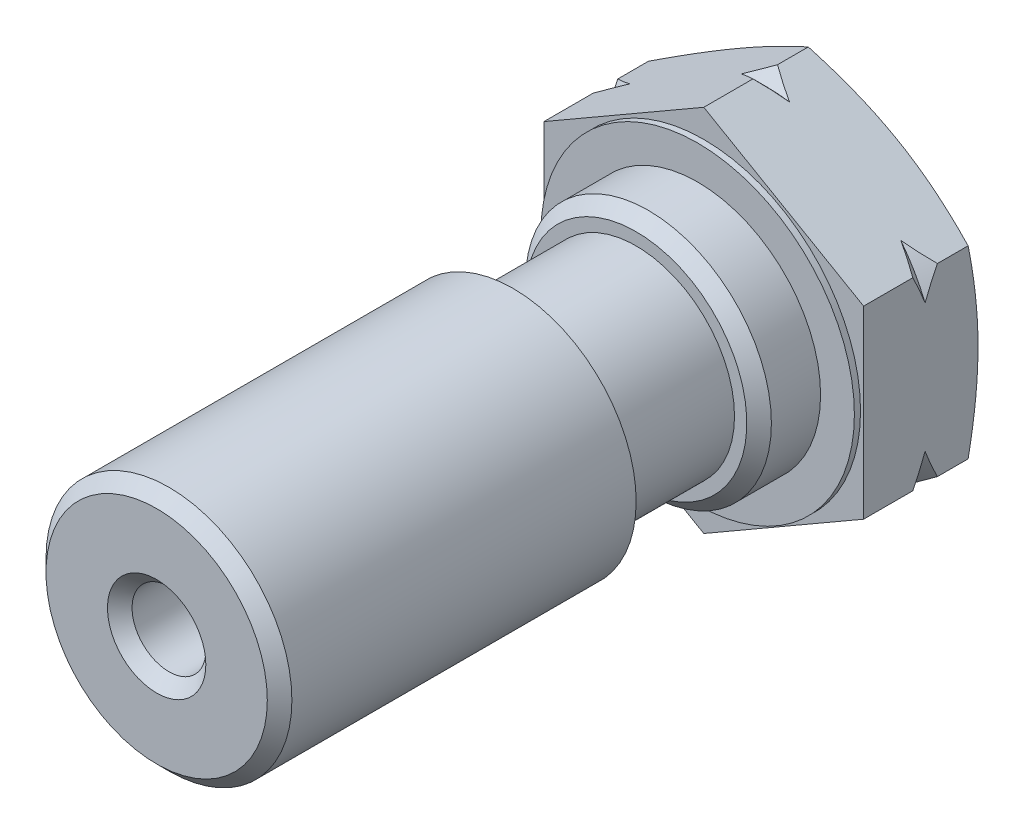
ISO-10303-21;
HEADER;
FILE_DESCRIPTION(('STEP AP214'),'2;1');
FILE_NAME('part.step','',(''),(''),'','','');
FILE_SCHEMA(('AUTOMOTIVE_DESIGN { 1 0 10303 214 1 1 1 1 }'));
ENDSEC;
DATA;
#1=APPLICATION_CONTEXT('core data for automotive mechanical design processes');
#2=APPLICATION_PROTOCOL_DEFINITION('international standard','automotive_design',2000,#1);
#3=PRODUCT_CONTEXT('',#1,'mechanical');
#4=PRODUCT('Part','Part','',(#3));
#5=PRODUCT_RELATED_PRODUCT_CATEGORY('part','',(#4));
#6=PRODUCT_DEFINITION_FORMATION('','',#4);
#7=PRODUCT_DEFINITION_CONTEXT('part definition',#1,'design');
#8=PRODUCT_DEFINITION('design','',#6,#7);
#9=PRODUCT_DEFINITION_SHAPE('','',#8);
#10=(LENGTH_UNIT() NAMED_UNIT(*) SI_UNIT(.MILLI.,.METRE.));
#11=(NAMED_UNIT(*) PLANE_ANGLE_UNIT() SI_UNIT($,.RADIAN.));
#12=(NAMED_UNIT(*) SI_UNIT($,.STERADIAN.) SOLID_ANGLE_UNIT());
#13=UNCERTAINTY_MEASURE_WITH_UNIT(LENGTH_MEASURE(1.E-05),#10,'distance_accuracy_value','');
#14=(GEOMETRIC_REPRESENTATION_CONTEXT(3) GLOBAL_UNCERTAINTY_ASSIGNED_CONTEXT((#13)) GLOBAL_UNIT_ASSIGNED_CONTEXT((#10,
#11,#12)) REPRESENTATION_CONTEXT('',''));
#15=CARTESIAN_POINT('',(0.,0.,0.));
#16=DIRECTION('',(0.,0.,1.));
#17=DIRECTION('',(1.,0.,0.));
#18=AXIS2_PLACEMENT_3D('',#15,#16,#17);
#19=CARTESIAN_POINT('',(0.,-1.88911386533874E-12,27.2499999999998));
#20=DIRECTION('',(0.,0.,-1.));
#21=DIRECTION('',(-1.,0.,0.));
#22=AXIS2_PLACEMENT_3D('',#19,#20,#21);
#23=CYLINDRICAL_SURFACE('',#22,5.);
#24=CARTESIAN_POINT('',(0.,-8.34401991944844E-13,7.25000000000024));
#25=DIRECTION('',(0.,0.,-1.));
#26=DIRECTION('',(-1.,0.,0.));
#27=AXIS2_PLACEMENT_3D('',#24,#25,#26);
#28=CIRCLE('',#27,5.);
#29=CARTESIAN_POINT('',(-5.,-8.02909955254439E-13,7.25000000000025));
#30=VERTEX_POINT('',#29);
#31=EDGE_CURVE('E419',#30,#30,#28,.T.);
#32=ORIENTED_EDGE('',*,*,#31,.T.);
#33=EDGE_LOOP('',(#32));
#34=FACE_BOUND('',#33,.T.);
#35=CARTESIAN_POINT('',(0.,1.09287578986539E-13,5.25));
#36=DIRECTION('',(0.,0.,1.));
#37=DIRECTION('',(1.,0.,0.));
#38=AXIS2_PLACEMENT_3D('',#35,#36,#37);
#39=CIRCLE('',#38,5.);
#40=CARTESIAN_POINT('',(5.,0.,5.25));
#41=VERTEX_POINT('',#40);
#42=EDGE_CURVE('E516',#41,#41,#39,.T.);
#43=ORIENTED_EDGE('',*,*,#42,.T.);
#44=EDGE_LOOP('',(#43));
#45=FACE_BOUND('',#44,.T.);
#46=ADVANCED_FACE('F24',(#34,#45),#23,.T.);
#47=CARTESIAN_POINT('',(0.,1.09287578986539E-13,5.25));
#48=DIRECTION('',(0.,0.,1.));
#49=DIRECTION('',(1.,0.,0.));
#50=AXIS2_PLACEMENT_3D('',#47,#48,#49);
#51=PLANE('',#50);
#52=CARTESIAN_POINT('',(0.,1.09287578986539E-13,5.25));
#53=DIRECTION('',(0.,0.,1.));
#54=DIRECTION('',(1.,0.,0.));
#55=AXIS2_PLACEMENT_3D('',#52,#53,#54);
#56=CIRCLE('',#55,6.375);
#57=CARTESIAN_POINT('',(6.375,0.,5.25));
#58=VERTEX_POINT('',#57);
#59=EDGE_CURVE('E511',#58,#58,#56,.T.);
#60=ORIENTED_EDGE('',*,*,#59,.T.);
#61=EDGE_LOOP('',(#60));
#62=FACE_BOUND('',#61,.T.);
#63=ORIENTED_EDGE('',*,*,#42,.F.);
#64=EDGE_LOOP('',(#63));
#65=FACE_BOUND('',#64,.T.);
#66=ADVANCED_FACE('F542',(#62,#65),#51,.T.);
#67=CARTESIAN_POINT('',(6.49999999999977,11.2583302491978,4.99999999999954));
#68=DIRECTION('',(0.,0.,-1.));
#69=DIRECTION('',(-1.,0.,0.));
#70=AXIS2_PLACEMENT_3D('',#67,#68,#69);
#71=PLANE('',#70);
#72=DIRECTION('',(-0.86602540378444,-0.499999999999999,0.));
#73=VECTOR('',#72,1.);
#74=CARTESIAN_POINT('',(-6.50000000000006,3.75277674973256,4.99999999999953));
#75=LINE('',#74,#73);
#76=CARTESIAN_POINT('',(0.,7.50555349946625,4.99999999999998));
#77=VERTEX_POINT('',#76);
#78=CARTESIAN_POINT('',(-6.50000000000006,3.75277674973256,4.99999999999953));
#79=VERTEX_POINT('',#78);
#80=EDGE_CURVE('E508',#77,#79,#75,.T.);
#81=ORIENTED_EDGE('',*,*,#80,.T.);
#82=DIRECTION('',(0.,-1.00000000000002,0.));
#83=VECTOR('',#82,1.);
#84=CARTESIAN_POINT('',(-6.50000000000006,3.75277674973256,4.99999999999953));
#85=LINE('',#84,#83);
#86=CARTESIAN_POINT('',(-6.5,-3.75277674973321,4.9999999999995));
#87=VERTEX_POINT('',#86);
#88=EDGE_CURVE('E505',#79,#87,#85,.T.);
#89=ORIENTED_EDGE('',*,*,#88,.T.);
#90=DIRECTION('',(0.866025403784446,-0.500000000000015,0.));
#91=VECTOR('',#90,1.);
#92=CARTESIAN_POINT('',(0.,-7.50555349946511,5.00000000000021));
#93=LINE('',#92,#91);
#94=CARTESIAN_POINT('',(0.,-7.50555349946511,5.00000000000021));
#95=VERTEX_POINT('',#94);
#96=EDGE_CURVE('E513',#87,#95,#93,.T.);
#97=ORIENTED_EDGE('',*,*,#96,.T.);
#98=DIRECTION('',(0.86602540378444,0.499999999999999,0.));
#99=VECTOR('',#98,1.);
#100=CARTESIAN_POINT('',(6.49999999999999,-3.75277674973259,4.99999999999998));
#101=LINE('',#100,#99);
#102=CARTESIAN_POINT('',(6.49999999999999,-3.75277674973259,4.99999999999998));
#103=VERTEX_POINT('',#102);
#104=EDGE_CURVE('E521',#95,#103,#101,.T.);
#105=ORIENTED_EDGE('',*,*,#104,.T.);
#106=DIRECTION('',(0.,1.00000000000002,0.));
#107=VECTOR('',#106,1.);
#108=CARTESIAN_POINT('',(6.5,3.75277674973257,5.));
#109=LINE('',#108,#107);
#110=CARTESIAN_POINT('',(6.5,3.75277674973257,5.));
#111=VERTEX_POINT('',#110);
#112=EDGE_CURVE('E523',#103,#111,#109,.T.);
#113=ORIENTED_EDGE('',*,*,#112,.T.);
#114=DIRECTION('',(-0.866025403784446,0.500000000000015,0.));
#115=VECTOR('',#114,1.);
#116=CARTESIAN_POINT('',(0.,7.50555349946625,4.99999999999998));
#117=LINE('',#116,#115);
#118=EDGE_CURVE('E524',#111,#77,#117,.T.);
#119=ORIENTED_EDGE('',*,*,#118,.T.);
#120=EDGE_LOOP('',(#81,#89,#97,#105,#113,#119));
#121=FACE_BOUND('',#120,.T.);
#122=CARTESIAN_POINT('',(0.,1.91339999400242E-12,5.00000000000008));
#123=DIRECTION('',(0.,0.,-1.));
#124=DIRECTION('',(-1.,0.,0.));
#125=AXIS2_PLACEMENT_3D('',#122,#123,#124);
#126=CIRCLE('',#125,6.375);
#127=CARTESIAN_POINT('',(-6.375,1.95355234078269E-12,5.00000000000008));
#128=VERTEX_POINT('',#127);
#129=EDGE_CURVE('E404',#128,#128,#126,.F.);
#130=ORIENTED_EDGE('',*,*,#129,.F.);
#131=EDGE_LOOP('',(#130));
#132=FACE_BOUND('',#131,.T.);
#133=ADVANCED_FACE('F544',(#121,#132),#71,.F.);
#134=CARTESIAN_POINT('',(-6.50000000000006,3.75277674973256,4.99999999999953));
#135=DIRECTION('',(0.500000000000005,-0.866025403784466,0.));
#136=DIRECTION('',(0.86602540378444,0.5,0.));
#137=AXIS2_PLACEMENT_3D('',#134,#135,#136);
#138=PLANE('',#137);
#139=DIRECTION('',(0.,0.,-1.));
#140=VECTOR('',#139,1.);
#141=CARTESIAN_POINT('',(-6.50000000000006,3.75277674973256,4.99999999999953));
#142=LINE('',#141,#140);
#143=CARTESIAN_POINT('',(-6.50000000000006,3.75277674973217,1.9999999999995));
#144=VERTEX_POINT('',#143);
#145=CARTESIAN_POINT('',(-6.50000000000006,3.75277674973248,0.749999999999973));
#146=VERTEX_POINT('',#145);
#147=EDGE_CURVE('E401',#144,#146,#142,.T.);
#148=ORIENTED_EDGE('',*,*,#147,.F.);
#149=CARTESIAN_POINT('',(-6.79918214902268,3.58004385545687,1.82144054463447));
#150=CARTESIAN_POINT('',(-6.70351312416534,3.63527839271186,1.88035197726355));
#151=CARTESIAN_POINT('',(-6.60723705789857,3.6908634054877,1.93794522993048));
#152=CARTESIAN_POINT('',(-6.41335804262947,3.80279950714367,2.05015006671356));
#153=CARTESIAN_POINT('',(-6.31575472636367,3.85915080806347,2.10476080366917));
#154=CARTESIAN_POINT('',(-6.02012491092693,4.0298327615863,2.26395116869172));
#155=CARTESIAN_POINT('',(-5.81999890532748,4.14537556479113,2.36343899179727));
#156=CARTESIAN_POINT('',(-5.41428096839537,4.37961692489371,2.54502495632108));
#157=CARTESIAN_POINT('',(-5.20869972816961,4.49830930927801,2.62715463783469));
#158=CARTESIAN_POINT('',(-4.79226521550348,4.73873788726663,2.76990300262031));
#159=CARTESIAN_POINT('',(-4.58142256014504,4.86046795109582,2.8305617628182));
#160=CARTESIAN_POINT('',(-4.28093897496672,5.03395222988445,2.89819060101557));
#161=CARTESIAN_POINT('',(-4.1930356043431,5.08470326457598,2.91574236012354));
#162=CARTESIAN_POINT('',(-4.01661293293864,5.18656094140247,2.94632674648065));
#163=CARTESIAN_POINT('',(-3.92809347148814,5.2376676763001,2.95935814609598));
#164=CARTESIAN_POINT('',(-3.69818266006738,5.37040674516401,2.98699740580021));
#165=CARTESIAN_POINT('',(-3.55645114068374,5.45223547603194,2.99798828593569));
#166=CARTESIAN_POINT('',(-3.27263200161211,5.61609853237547,3.00756627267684));
#167=CARTESIAN_POINT('',(-3.13054427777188,5.69813291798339,3.00614918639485));
#168=CARTESIAN_POINT('',(-2.84673741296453,5.86198888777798,2.99095333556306));
#169=CARTESIAN_POINT('',(-2.70501872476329,5.94381021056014,2.97716332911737));
#170=CARTESIAN_POINT('',(-2.42286143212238,6.10671379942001,2.93775018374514));
#171=CARTESIAN_POINT('',(-2.28242266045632,6.1877961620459,2.91212861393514));
#172=CARTESIAN_POINT('',(-1.946003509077,6.38202784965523,2.83715852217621));
#173=CARTESIAN_POINT('',(-1.75092504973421,6.49465645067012,2.78238595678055));
#174=CARTESIAN_POINT('',(-1.36558369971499,6.71713338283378,2.65433275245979));
#175=CARTESIAN_POINT('',(-1.17531847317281,6.82698306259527,2.58106128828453));
#176=CARTESIAN_POINT('',(-0.819029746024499,7.03268645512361,2.42763744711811));
#177=CARTESIAN_POINT('',(-0.652522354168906,7.12881954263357,2.34896300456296));
#178=CARTESIAN_POINT('',(-0.323342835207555,7.31887142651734,2.18153326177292));
#179=CARTESIAN_POINT('',(-0.160671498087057,7.41278976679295,2.09277590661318));
#180=CARTESIAN_POINT('',(0.0946376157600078,7.56019255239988,1.94535379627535));
#181=CARTESIAN_POINT('',(0.188454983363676,7.61435803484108,1.88939842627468));
#182=CARTESIAN_POINT('',(0.281679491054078,7.66818122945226,1.8322004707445));
#183=B_SPLINE_CURVE_WITH_KNOTS('',3,(#149,#150,#151,#152,#153,#154,#155,#156,#157,#158,#159,
#160,#161,#162,#163,#164,#165,#166,#167,#168,#169,#170,#171,#172,#173,#174,#175,#176,#177,#178,
#179,#180,#181,#182),.UNSPECIFIED.,.F.,.F.,(4,2,2,2,2,2,2,2,2,2,2,2,2,2,2,2,4),(0.,
0.375569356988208,0.751244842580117,1.50542896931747,2.25823071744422,3.00961980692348,
3.31856110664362,3.6275862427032,4.11917923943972,4.61093836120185,5.10314474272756,
5.59528586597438,6.28975008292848,6.98387054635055,7.60675392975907,8.22976448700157,
8.59549510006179),.UNSPECIFIED.);
#184=CARTESIAN_POINT('',(-5.51292617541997,4.32266408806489,2.49999999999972));
#185=VERTEX_POINT('',#184);
#186=EDGE_CURVE('E309',#144,#185,#183,.T.);
#187=ORIENTED_EDGE('',*,*,#186,.T.);
#188=CARTESIAN_POINT('',(-2.67155812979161,5.96312869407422,2.02867382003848));
#189=CARTESIAN_POINT('',(-2.74250520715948,5.92216737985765,2.02029660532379));
#190=CARTESIAN_POINT('',(-2.81358099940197,5.88113175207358,2.0134356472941));
#191=CARTESIAN_POINT('',(-2.95590612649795,5.79896030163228,2.00279522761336));
#192=CARTESIAN_POINT('',(-3.02715546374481,5.75782447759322,1.99901580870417));
#193=CARTESIAN_POINT('',(-3.24094557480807,5.63439269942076,1.99237640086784));
#194=CARTESIAN_POINT('',(-3.38361765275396,5.55202093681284,1.99420463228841));
#195=CARTESIAN_POINT('',(-3.66743996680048,5.38815604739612,2.01025155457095));
#196=CARTESIAN_POINT('',(-3.80859394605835,5.30666075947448,2.0243856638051));
#197=CARTESIAN_POINT('',(-4.08963920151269,5.14439920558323,2.0643829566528));
#198=CARTESIAN_POINT('',(-4.22953053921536,5.06363290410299,2.09024556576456));
#199=CARTESIAN_POINT('',(-4.46590913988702,4.92715965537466,2.14343546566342));
#200=CARTESIAN_POINT('',(-4.56287084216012,4.87117879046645,2.1680139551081));
#201=CARTESIAN_POINT('',(-4.75574117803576,4.75982505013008,2.22210156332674));
#202=CARTESIAN_POINT('',(-4.85164992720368,4.70445210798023,2.2516101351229));
#203=CARTESIAN_POINT('',(-5.1378041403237,4.53924089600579,2.34698250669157));
#204=CARTESIAN_POINT('',(-5.32636294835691,4.4303764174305,2.4196663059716));
#205=CARTESIAN_POINT('',(-5.68101814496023,4.22561614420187,2.5723799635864));
#206=CARTESIAN_POINT('',(-5.84755645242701,4.12946520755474,2.65107150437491));
#207=CARTESIAN_POINT('',(-6.17673335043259,3.93941483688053,2.81851106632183));
#208=CARTESIAN_POINT('',(-6.33937296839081,3.84551480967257,2.90725640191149));
#209=CARTESIAN_POINT('',(-6.55037962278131,3.7236900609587,3.02908842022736));
#210=CARTESIAN_POINT('',(-6.60038278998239,3.69482071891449,3.05846184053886));
#211=CARTESIAN_POINT('',(-6.7000386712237,3.63728436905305,3.1179581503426));
#212=CARTESIAN_POINT('',(-6.74969146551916,3.60861731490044,3.1480808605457));
#213=CARTESIAN_POINT('',(-6.79918214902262,3.58004385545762,3.17855945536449));
#214=B_SPLINE_CURVE_WITH_KNOTS('',3,(#188,#189,#190,#191,#192,#193,#194,#195,#196,#197,#198,
#199,#200,#201,#202,#203,#204,#205,#206,#207,#208,#209,#210,#211,#212,#213),.UNSPECIFIED.,.F.,
.F.,(4,2,2,2,2,2,2,2,2,2,2,2,4),(0.,0.247021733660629,0.494046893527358,0.987787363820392,
1.47816077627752,1.96851017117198,2.31228221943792,2.65601615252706,3.34388772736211,
3.96691770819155,4.58978165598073,4.78412136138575,4.97841500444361),.UNSPECIFIED.);
#215=CARTESIAN_POINT('',(-6.50000000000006,3.75277674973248,2.99999999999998));
#216=VERTEX_POINT('',#215);
#217=EDGE_CURVE('E268',#185,#216,#214,.T.);
#218=ORIENTED_EDGE('',*,*,#217,.T.);
#219=EDGE_CURVE('E402',#79,#216,#142,.T.);
#220=ORIENTED_EDGE('',*,*,#219,.F.);
#221=ORIENTED_EDGE('',*,*,#80,.F.);
#222=DIRECTION('',(0.,0.,-1.));
#223=VECTOR('',#222,1.);
#224=CARTESIAN_POINT('',(0.,7.50555349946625,4.99999999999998));
#225=LINE('',#224,#223);
#226=CARTESIAN_POINT('',(0.,7.50555349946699,3.00000000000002));
#227=VERTEX_POINT('',#226);
#228=EDGE_CURVE('E383',#77,#227,#225,.T.);
#229=ORIENTED_EDGE('',*,*,#228,.T.);
#230=CARTESIAN_POINT('',(0.281679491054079,7.66818122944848,3.16779952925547));
#231=CARTESIAN_POINT('',(0.235067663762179,7.64126987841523,3.13919530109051));
#232=CARTESIAN_POINT('',(0.188311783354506,7.61427535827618,3.11090873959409));
#233=CARTESIAN_POINT('',(0.0944894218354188,7.56010699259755,3.0550016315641));
#234=CARTESIAN_POINT('',(0.0474228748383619,7.53293310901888,3.02738123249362));
#235=CARTESIAN_POINT('',(-0.160625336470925,7.41281641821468,2.90725740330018));
#236=CARTESIAN_POINT('',(-0.323263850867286,7.31891702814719,2.81851263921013));
#237=CARTESIAN_POINT('',(-0.652440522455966,7.12886678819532,2.65107289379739));
#238=CARTESIAN_POINT('',(-0.818979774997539,7.03271530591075,2.57238077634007));
#239=CARTESIAN_POINT('',(-1.17544928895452,6.82690753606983,2.41888605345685));
#240=CARTESIAN_POINT('',(-1.36586982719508,6.7169681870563,2.34556732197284));
#241=CARTESIAN_POINT('',(-1.6548764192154,6.55011015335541,2.24953448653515));
#242=CARTESIAN_POINT('',(-1.7517452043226,6.49418293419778,2.21985452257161));
#243=CARTESIAN_POINT('',(-1.94655247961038,6.38171090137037,2.16553234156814));
#244=CARTESIAN_POINT('',(-2.04449108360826,6.32516602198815,2.14089066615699));
#245=CARTESIAN_POINT('',(-2.28185023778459,6.18812665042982,2.08800336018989));
#246=CARTESIAN_POINT('',(-2.42173214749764,6.1073657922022,2.06245768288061));
#247=CARTESIAN_POINT('',(-2.70273983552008,5.94512592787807,2.02310549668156));
#248=CARTESIAN_POINT('',(-2.84386567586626,5.8636468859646,2.00929957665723));
#249=CARTESIAN_POINT('',(-3.1276115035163,5.69982615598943,1.99391044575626));
#250=CARTESIAN_POINT('',(-3.27023509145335,5.6174823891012,1.99241195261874));
#251=CARTESIAN_POINT('',(-3.48393595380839,5.49410213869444,1.99953554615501));
#252=CARTESIAN_POINT('',(-3.55515244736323,5.4529852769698,2.00347463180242));
#253=CARTESIAN_POINT('',(-3.69740686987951,5.37085464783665,2.01442935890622));
#254=CARTESIAN_POINT('',(-3.76844480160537,5.3298408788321,2.02144495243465));
#255=CARTESIAN_POINT('',(-3.83935176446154,5.28890272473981,2.02997356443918));
#256=B_SPLINE_CURVE_WITH_KNOTS('',3,(#230,#231,#232,#233,#234,#235,#236,#237,#238,#239,#240,
#241,#242,#243,#244,#245,#246,#247,#248,#249,#250,#251,#252,#253,#254,#255),.UNSPECIFIED.,.F.,
.F.,(4,2,2,2,2,2,2,2,2,2,2,2,4),(0.,0.182848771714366,0.365737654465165,0.988596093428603,
1.61163158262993,2.30619924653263,2.65327623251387,3.00039051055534,3.49055756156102,
3.98074919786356,4.47431224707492,4.72124635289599,4.96817661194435),.UNSPECIFIED.);
#257=CARTESIAN_POINT('',(-0.98707382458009,6.93566616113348,2.49999999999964));
#258=VERTEX_POINT('',#257);
#259=EDGE_CURVE('E233',#227,#258,#256,.T.);
#260=ORIENTED_EDGE('',*,*,#259,.T.);
#261=CARTESIAN_POINT('',(0.,7.50555349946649,2.0000000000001));
#262=VERTEX_POINT('',#261);
#263=EDGE_CURVE('E467',#258,#262,#183,.T.);
#264=ORIENTED_EDGE('',*,*,#263,.T.);
#265=CARTESIAN_POINT('',(0.,7.50555349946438,0.75000000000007));
#266=VERTEX_POINT('',#265);
#267=EDGE_CURVE('E377',#262,#266,#225,.T.);
#268=ORIENTED_EDGE('',*,*,#267,.T.);
#269=CARTESIAN_POINT('',(0.000200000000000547,7.50566896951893,0.750046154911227));
#270=CARTESIAN_POINT('',(-0.229365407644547,7.37312931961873,0.69706343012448));
#271=CARTESIAN_POINT('',(-0.459682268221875,7.24015581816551,0.648119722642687));
#272=CARTESIAN_POINT('',(-0.921824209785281,6.97333804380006,0.559843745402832));
#273=CARTESIAN_POINT('',(-1.15365009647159,6.8394933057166,0.520517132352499));
#274=CARTESIAN_POINT('',(-1.61845419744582,6.57113853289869,0.453087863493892));
#275=CARTESIAN_POINT('',(-1.85143192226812,6.43662878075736,0.424980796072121));
#276=CARTESIAN_POINT('',(-2.31822882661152,6.16712346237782,0.381316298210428));
#277=CARTESIAN_POINT('',(-2.55204780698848,6.03212801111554,0.365756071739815));
#278=CARTESIAN_POINT('',(-3.01616088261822,5.76417220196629,0.348162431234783));
#279=CARTESIAN_POINT('',(-3.24644857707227,5.63121553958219,0.345907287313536));
#280=CARTESIAN_POINT('',(-3.70686042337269,5.36539663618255,0.354455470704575));
#281=CARTESIAN_POINT('',(-3.93698455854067,5.23253440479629,0.36525997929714));
#282=CARTESIAN_POINT('',(-4.39638367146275,4.96730020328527,0.399339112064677));
#283=CARTESIAN_POINT('',(-4.62565908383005,4.83492798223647,0.422606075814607));
#284=CARTESIAN_POINT('',(-5.08310304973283,4.57082258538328,0.48047301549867));
#285=CARTESIAN_POINT('',(-5.31127171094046,4.43908934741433,0.515071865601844));
#286=CARTESIAN_POINT('',(-5.61910717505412,4.26136045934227,0.568584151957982));
#287=CARTESIAN_POINT('',(-5.69935770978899,4.21502779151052,0.583165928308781));
#288=CARTESIAN_POINT('',(-5.859682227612,4.12246438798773,0.61349553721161));
#289=CARTESIAN_POINT('',(-5.93975623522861,4.07623363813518,0.629243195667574));
#290=CARTESIAN_POINT('',(-6.09998717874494,3.98372425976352,0.661892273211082));
#291=CARTESIAN_POINT('',(-6.18014358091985,3.93744593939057,0.678797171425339));
#292=CARTESIAN_POINT('',(-6.34029510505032,3.8449824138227,0.713653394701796));
#293=CARTESIAN_POINT('',(-6.4202902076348,3.79879721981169,0.73160483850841));
#294=CARTESIAN_POINT('',(-6.50020000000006,3.75266127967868,0.750046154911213));
#295=B_SPLINE_CURVE_WITH_KNOTS('',3,(#269,#270,#271,#272,#273,#274,#275,#276,#277,#278,#279,
#280,#281,#282,#283,#284,#285,#286,#287,#288,#289,#290,#291,#292,#293,#294),.UNSPECIFIED.,.F.,
.F.,(4,2,2,2,2,2,2,2,2,2,2,2,4),(0.,0.811024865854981,1.62252562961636,2.43370698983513,
3.24470753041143,4.04215365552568,4.83967191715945,5.63670052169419,6.43364996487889,
6.71506265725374,6.99643341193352,7.27869076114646,7.5609801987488),.UNSPECIFIED.);
#296=EDGE_CURVE('E354',#266,#146,#295,.T.);
#297=ORIENTED_EDGE('',*,*,#296,.T.);
#298=EDGE_LOOP('',(#148,#187,#218,#220,#221,#229,#260,#264,#268,#297));
#299=FACE_BOUND('',#298,.T.);
#300=ADVANCED_FACE('F26',(#299),#138,.F.);
#301=CARTESIAN_POINT('',(-6.50000000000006,3.75277674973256,4.99999999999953));
#302=DIRECTION('',(1.,0.,0.));
#303=DIRECTION('',(0.,1.00000000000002,0.));
#304=AXIS2_PLACEMENT_3D('',#301,#302,#303);
#305=PLANE('',#304);
#306=DIRECTION('',(0.,0.,-1.));
#307=VECTOR('',#306,1.);
#308=CARTESIAN_POINT('',(-6.5,-3.75277674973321,4.9999999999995));
#309=LINE('',#308,#307);
#310=CARTESIAN_POINT('',(-6.49999999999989,-3.75277674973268,2.));
#311=VERTEX_POINT('',#310);
#312=CARTESIAN_POINT('',(-6.49999999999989,-3.75277674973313,0.749999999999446));
#313=VERTEX_POINT('',#312);
#314=EDGE_CURVE('E397',#311,#313,#309,.T.);
#315=ORIENTED_EDGE('',*,*,#314,.F.);
#316=CARTESIAN_POINT('',(-6.49999999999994,-8.03733178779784,-0.831211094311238));
#317=CARTESIAN_POINT('',(-6.50000000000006,-7.8332260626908,-0.672551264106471));
#318=CARTESIAN_POINT('',(-6.50000000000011,-7.62798906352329,-0.515320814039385));
#319=CARTESIAN_POINT('',(-6.50000000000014,-7.21473903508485,-0.20442562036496));
#320=CARTESIAN_POINT('',(-6.50000000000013,-7.00672519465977,-0.0507619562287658));
#321=CARTESIAN_POINT('',(-6.50000000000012,-6.58591465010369,0.253364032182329));
#322=CARTESIAN_POINT('',(-6.50000000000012,-6.37309344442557,0.403792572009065));
#323=CARTESIAN_POINT('',(-6.50000000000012,-5.94367642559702,0.699136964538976));
#324=CARTESIAN_POINT('',(-6.50000000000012,-5.72708098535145,0.844053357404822));
#325=CARTESIAN_POINT('',(-6.50000000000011,-5.29845265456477,1.12116426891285));
#326=CARTESIAN_POINT('',(-6.50000000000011,-5.08660037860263,1.25363699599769));
#327=CARTESIAN_POINT('',(-6.50000000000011,-4.6580742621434,1.51066466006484));
#328=CARTESIAN_POINT('',(-6.5000000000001,-4.44139970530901,1.63521840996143));
#329=CARTESIAN_POINT('',(-6.50000000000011,-4.00312305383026,1.87395437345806));
#330=CARTESIAN_POINT('',(-6.50000000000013,-3.78153570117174,1.98816345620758));
#331=CARTESIAN_POINT('',(-6.50000000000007,-3.33227917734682,2.2038220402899));
#332=CARTESIAN_POINT('',(-6.5,-3.1046125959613,2.30527687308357));
#333=CARTESIAN_POINT('',(-6.5,-2.66065920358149,2.48478632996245));
#334=CARTESIAN_POINT('',(-6.50000000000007,-2.44486420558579,2.56404712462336));
#335=CARTESIAN_POINT('',(-6.50000000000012,-2.00783396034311,2.70564361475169));
#336=CARTESIAN_POINT('',(-6.50000000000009,-1.78660263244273,2.76799113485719));
#337=CARTESIAN_POINT('',(-6.50000000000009,-1.44927250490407,2.84686502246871));
#338=CARTESIAN_POINT('',(-6.50000000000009,-1.33489353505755,2.87085805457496));
#339=CARTESIAN_POINT('',(-6.50000000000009,-1.10510100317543,2.91324726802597));
#340=CARTESIAN_POINT('',(-6.50000000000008,-0.989687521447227,2.93164388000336));
#341=CARTESIAN_POINT('',(-6.50000000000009,-0.757681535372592,2.96255423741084));
#342=CARTESIAN_POINT('',(-6.50000000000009,-0.641086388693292,2.97504824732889));
#343=CARTESIAN_POINT('',(-6.50000000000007,-0.4073600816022,2.99384881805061));
#344=CARTESIAN_POINT('',(-6.50000000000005,-0.290228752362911,3.00015327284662));
#345=CARTESIAN_POINT('',(-6.5,-0.173001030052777,3.00325164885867));
#346=B_SPLINE_CURVE_WITH_KNOTS('',3,(#316,#317,#318,#319,#320,#321,#322,#323,#324,#325,#326,
#327,#328,#329,#330,#331,#332,#333,#334,#335,#336,#337,#338,#339,#340,#341,#342,#343,#344,#345),
.UNSPECIFIED.,.F.,.F.,(4,2,2,2,2,2,2,2,2,2,2,2,2,2,4),(0.,0.775574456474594,1.5513806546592,
2.33316382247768,3.11487018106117,3.86431535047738,4.61387260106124,5.36142350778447,
6.1086608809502,6.79779024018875,7.48643655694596,7.83692540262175,8.18738727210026,
8.53901276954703,8.89075786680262),.UNSPECIFIED.);
#347=CARTESIAN_POINT('',(-6.49999999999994,-2.61300207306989,2.49999999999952));
#348=VERTEX_POINT('',#347);
#349=EDGE_CURVE('E292',#311,#348,#346,.T.);
#350=ORIENTED_EDGE('',*,*,#349,.T.);
#351=CARTESIAN_POINT('',(-6.5,-0.173001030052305,1.99674835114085));
#352=CARTESIAN_POINT('',(-6.50000000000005,-0.274790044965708,1.99944812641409));
#353=CARTESIAN_POINT('',(-6.50000000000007,-0.37649821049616,2.00455219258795));
#354=CARTESIAN_POINT('',(-6.50000000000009,-0.579551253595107,2.01944842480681));
#355=CARTESIAN_POINT('',(-6.50000000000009,-0.68089619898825,2.02923966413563));
#356=CARTESIAN_POINT('',(-6.50000000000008,-0.983792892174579,2.06542457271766));
#357=CARTESIAN_POINT('',(-6.50000000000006,-1.18456153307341,2.09863967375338));
#358=CARTESIAN_POINT('',(-6.50000000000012,-1.58047020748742,2.18105457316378));
#359=CARTESIAN_POINT('',(-6.50000000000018,-1.77564740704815,2.23008045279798));
#360=CARTESIAN_POINT('',(-6.5,-2.16194334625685,2.34206035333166));
#361=CARTESIAN_POINT('',(-6.49999999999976,-2.35306207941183,2.40501439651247));
#362=CARTESIAN_POINT('',(-6.49999999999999,-2.59761258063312,2.49408261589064));
#363=CARTESIAN_POINT('',(-6.50000000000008,-2.65304753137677,2.51484948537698));
#364=CARTESIAN_POINT('',(-6.50000000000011,-2.76360155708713,2.55737008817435));
#365=CARTESIAN_POINT('',(-6.50000000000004,-2.81872026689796,2.57912477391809));
#366=CARTESIAN_POINT('',(-6.49999999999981,-3.11105833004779,2.69732848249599));
#367=CARTESIAN_POINT('',(-6.50000000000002,-3.34504114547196,2.8018713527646));
#368=CARTESIAN_POINT('',(-6.50000000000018,-3.80660094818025,3.02433894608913));
#369=CARTESIAN_POINT('',(-6.50000000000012,-4.03417419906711,3.14227128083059));
#370=CARTESIAN_POINT('',(-6.50000000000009,-4.48428229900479,3.3889542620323));
#371=CARTESIAN_POINT('',(-6.5000000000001,-4.70679895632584,3.51773791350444));
#372=CARTESIAN_POINT('',(-6.50000000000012,-5.1467820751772,3.78351417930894));
#373=CARTESIAN_POINT('',(-6.50000000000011,-5.36424949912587,3.92050521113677));
#374=CARTESIAN_POINT('',(-6.50000000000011,-5.79198196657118,4.19910567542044));
#375=CARTESIAN_POINT('',(-6.50000000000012,-6.00230475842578,4.34062683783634));
#376=CARTESIAN_POINT('',(-6.50000000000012,-6.41942612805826,4.62879447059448));
#377=CARTESIAN_POINT('',(-6.50000000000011,-6.62622438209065,4.77544140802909));
#378=CARTESIAN_POINT('',(-6.50000000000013,-7.03520573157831,5.07173020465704));
#379=CARTESIAN_POINT('',(-6.50000000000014,-7.23741221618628,5.2213398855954));
#380=CARTESIAN_POINT('',(-6.50000000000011,-7.63921317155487,5.52391874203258));
#381=CARTESIAN_POINT('',(-6.50000000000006,-7.83880833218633,5.67688700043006));
#382=CARTESIAN_POINT('',(-6.49999999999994,-8.03733178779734,5.83121109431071));
#383=B_SPLINE_CURVE_WITH_KNOTS('',3,(#351,#352,#353,#354,#355,#356,#357,#358,#359,#360,#361,
#362,#363,#364,#365,#366,#367,#368,#369,#370,#371,#372,#373,#374,#375,#376,#377,#378,#379,#380,
#381,#382),.UNSPECIFIED.,.F.,.F.,(4,2,2,2,2,2,2,2,2,2,2,2,2,2,2,4),(0.,0.305414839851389,
0.610769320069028,1.22041678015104,1.8235746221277,2.42673342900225,2.60432076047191,
2.78208311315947,3.5502775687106,4.31891093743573,5.08997294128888,5.86088674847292,
6.62130486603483,7.38179245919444,8.13636324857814,8.89073049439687),.UNSPECIFIED.);
#384=CARTESIAN_POINT('',(-6.49999999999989,-3.75277674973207,2.99999999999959));
#385=VERTEX_POINT('',#384);
#386=EDGE_CURVE('E258',#348,#385,#383,.T.);
#387=ORIENTED_EDGE('',*,*,#386,.T.);
#388=EDGE_CURVE('E398',#87,#385,#309,.T.);
#389=ORIENTED_EDGE('',*,*,#388,.F.);
#390=ORIENTED_EDGE('',*,*,#88,.F.);
#391=ORIENTED_EDGE('',*,*,#219,.T.);
#392=CARTESIAN_POINT('',(-6.50000000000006,8.03733178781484,5.8312110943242));
#393=CARTESIAN_POINT('',(-6.50000000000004,7.83322606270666,5.67255126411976));
#394=CARTESIAN_POINT('',(-6.50000000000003,7.62798906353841,5.5153208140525));
#395=CARTESIAN_POINT('',(-6.50000000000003,7.21473903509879,5.20442562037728));
#396=CARTESIAN_POINT('',(-6.50000000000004,7.00672519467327,5.05076195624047));
#397=CARTESIAN_POINT('',(-6.50000000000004,6.58591465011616,4.74663596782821));
#398=CARTESIAN_POINT('',(-6.50000000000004,6.37309344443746,4.59620742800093));
#399=CARTESIAN_POINT('',(-6.50000000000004,5.94367642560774,4.30086303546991));
#400=CARTESIAN_POINT('',(-6.50000000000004,5.72708098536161,4.1559466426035));
#401=CARTESIAN_POINT('',(-6.50000000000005,5.29845265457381,3.8788357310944));
#402=CARTESIAN_POINT('',(-6.50000000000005,5.0866003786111,3.74636300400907));
#403=CARTESIAN_POINT('',(-6.50000000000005,4.65807426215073,3.48933533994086));
#404=CARTESIAN_POINT('',(-6.50000000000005,4.44139970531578,3.36478159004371));
#405=CARTESIAN_POINT('',(-6.50000000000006,4.00312305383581,3.12604562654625));
#406=CARTESIAN_POINT('',(-6.50000000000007,3.78153570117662,3.01183654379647));
#407=CARTESIAN_POINT('',(-6.50000000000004,3.33227917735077,2.79617795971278));
#408=CARTESIAN_POINT('',(-6.49999999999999,3.10461259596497,2.694723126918));
#409=CARTESIAN_POINT('',(-6.5,2.66065920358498,2.51521367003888));
#410=CARTESIAN_POINT('',(-6.50000000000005,2.44486420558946,2.43595287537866));
#411=CARTESIAN_POINT('',(-6.50000000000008,2.00783396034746,2.29435638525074));
#412=CARTESIAN_POINT('',(-6.50000000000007,1.78660263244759,2.23200886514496));
#413=CARTESIAN_POINT('',(-6.50000000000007,1.4492725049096,2.15313497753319));
#414=CARTESIAN_POINT('',(-6.50000000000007,1.33489353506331,2.12914194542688));
#415=CARTESIAN_POINT('',(-6.50000000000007,1.10510100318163,2.08675273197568));
#416=CARTESIAN_POINT('',(-6.50000000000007,0.989687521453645,2.06835611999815));
#417=CARTESIAN_POINT('',(-6.50000000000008,0.757681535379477,2.03744576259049));
#418=CARTESIAN_POINT('',(-6.50000000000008,0.641086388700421,2.02495175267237));
#419=CARTESIAN_POINT('',(-6.50000000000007,0.407360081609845,2.00615118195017));
#420=CARTESIAN_POINT('',(-6.50000000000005,0.290228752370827,1.99984672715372));
#421=CARTESIAN_POINT('',(-6.5,0.173001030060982,1.99674835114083));
#422=B_SPLINE_CURVE_WITH_KNOTS('',3,(#392,#393,#394,#395,#396,#397,#398,#399,#400,#401,#402,
#403,#404,#405,#406,#407,#408,#409,#410,#411,#412,#413,#414,#415,#416,#417,#418,#419,#420,#421),
.UNSPECIFIED.,.F.,.F.,(4,2,2,2,2,2,2,2,2,2,2,2,2,2,4),(0.,0.7755744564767,1.55138065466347,
2.33316382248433,3.11487018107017,3.86431535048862,4.61387260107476,5.36142350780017,
6.10866088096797,6.79779024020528,7.48643655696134,7.83692540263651,8.18738727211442,
8.53901276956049,8.89075786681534),.UNSPECIFIED.);
#423=CARTESIAN_POINT('',(-6.5,2.61300207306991,2.49999999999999));
#424=VERTEX_POINT('',#423);
#425=EDGE_CURVE('E263',#216,#424,#422,.T.);
#426=ORIENTED_EDGE('',*,*,#425,.T.);
#427=CARTESIAN_POINT('',(-6.5,0.173001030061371,3.00325164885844));
#428=CARTESIAN_POINT('',(-6.50000000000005,0.274790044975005,3.00055187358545));
#429=CARTESIAN_POINT('',(-6.50000000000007,0.376498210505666,2.99544780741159));
#430=CARTESIAN_POINT('',(-6.50000000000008,0.579551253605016,2.98055157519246));
#431=CARTESIAN_POINT('',(-6.50000000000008,0.680896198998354,2.97076033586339));
#432=CARTESIAN_POINT('',(-6.50000000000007,0.983792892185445,2.93457542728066));
#433=CARTESIAN_POINT('',(-6.50000000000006,1.18456153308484,2.90136032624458));
#434=CARTESIAN_POINT('',(-6.50000000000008,1.58047020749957,2.81894542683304));
#435=CARTESIAN_POINT('',(-6.50000000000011,1.77564740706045,2.76991954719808));
#436=CARTESIAN_POINT('',(-6.50000000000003,2.16194334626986,2.6579396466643));
#437=CARTESIAN_POINT('',(-6.49999999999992,2.35306207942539,2.59498560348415));
#438=CARTESIAN_POINT('',(-6.50000000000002,2.59761258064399,2.50591738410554));
#439=CARTESIAN_POINT('',(-6.50000000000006,2.65304753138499,2.48515051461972));
#440=CARTESIAN_POINT('',(-6.50000000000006,2.76360155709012,2.4426299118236));
#441=CARTESIAN_POINT('',(-6.50000000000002,2.81872026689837,2.42087522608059));
#442=CARTESIAN_POINT('',(-6.49999999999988,3.11105833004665,2.30267151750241));
#443=CARTESIAN_POINT('',(-6.50000000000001,3.34504114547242,2.19812864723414));
#444=CARTESIAN_POINT('',(-6.50000000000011,3.8066009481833,1.975661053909));
#445=CARTESIAN_POINT('',(-6.50000000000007,4.03417419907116,1.85772871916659));
#446=CARTESIAN_POINT('',(-6.50000000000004,4.48428229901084,1.61104573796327));
#447=CARTESIAN_POINT('',(-6.50000000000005,4.70679895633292,1.48226208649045));
#448=CARTESIAN_POINT('',(-6.50000000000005,5.14678207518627,1.21648582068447));
#449=CARTESIAN_POINT('',(-6.50000000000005,5.36424949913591,1.07949478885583));
#450=CARTESIAN_POINT('',(-6.50000000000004,5.79198196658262,0.800894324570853));
#451=CARTESIAN_POINT('',(-6.50000000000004,6.00230475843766,0.659373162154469));
#452=CARTESIAN_POINT('',(-6.50000000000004,6.41942612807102,0.371205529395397));
#453=CARTESIAN_POINT('',(-6.50000000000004,6.62622438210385,0.224558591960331));
#454=CARTESIAN_POINT('',(-6.50000000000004,7.03520573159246,-0.071730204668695));
#455=CARTESIAN_POINT('',(-6.50000000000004,7.23741221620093,-0.221339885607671));
#456=CARTESIAN_POINT('',(-6.50000000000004,7.63921317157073,-0.523918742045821));
#457=CARTESIAN_POINT('',(-6.50000000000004,7.8388083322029,-0.676887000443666));
#458=CARTESIAN_POINT('',(-6.50000000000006,8.03733178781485,-0.83121109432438));
#459=B_SPLINE_CURVE_WITH_KNOTS('',3,(#427,#428,#429,#430,#431,#432,#433,#434,#435,#436,#437,
#438,#439,#440,#441,#442,#443,#444,#445,#446,#447,#448,#449,#450,#451,#452,#453,#454,#455,#456,
#457,#458),.UNSPECIFIED.,.F.,.F.,(4,2,2,2,2,2,2,2,2,2,2,2,2,2,2,4),(0.,0.305414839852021,
0.610769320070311,1.22041678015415,1.82357462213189,2.42673342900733,2.60432076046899,
2.78208311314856,3.55027756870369,4.31891093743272,5.08997294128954,5.86088674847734,
6.62130486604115,7.38179245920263,8.13636324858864,8.89073049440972),.UNSPECIFIED.);
#460=EDGE_CURVE('E298',#424,#144,#459,.T.);
#461=ORIENTED_EDGE('',*,*,#460,.T.);
#462=ORIENTED_EDGE('',*,*,#147,.T.);
#463=CARTESIAN_POINT('',(-6.49999999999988,-9.9049180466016,2.48539476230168));
#464=CARTESIAN_POINT('',(-6.50000000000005,-9.61177926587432,2.38746357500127));
#465=CARTESIAN_POINT('',(-6.50000000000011,-9.31825687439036,2.29065941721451));
#466=CARTESIAN_POINT('',(-6.50000000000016,-8.73024673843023,2.09993431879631));
#467=CARTESIAN_POINT('',(-6.50000000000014,-8.43575890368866,2.00601365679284));
#468=CARTESIAN_POINT('',(-6.50000000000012,-7.84497836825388,1.82148586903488));
#469=CARTESIAN_POINT('',(-6.50000000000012,-7.54868304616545,1.7308871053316));
#470=CARTESIAN_POINT('',(-6.50000000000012,-6.95477750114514,1.55411589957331));
#471=CARTESIAN_POINT('',(-6.50000000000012,-6.65716730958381,1.46794335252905));
#472=CARTESIAN_POINT('',(-6.50000000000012,-6.06428870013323,1.30222620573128));
#473=CARTESIAN_POINT('',(-6.50000000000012,-5.7690404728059,1.22260973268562));
#474=CARTESIAN_POINT('',(-6.50000000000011,-5.17678236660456,1.07013701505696));
#475=CARTESIAN_POINT('',(-6.50000000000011,-4.87977243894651,0.997280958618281));
#476=CARTESIAN_POINT('',(-6.50000000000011,-4.28394804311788,0.860071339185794));
#477=CARTESIAN_POINT('',(-6.50000000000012,-3.98513464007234,0.795713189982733));
#478=CARTESIAN_POINT('',(-6.50000000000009,-3.38542897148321,0.677491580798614));
#479=CARTESIAN_POINT('',(-6.50000000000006,-3.08453684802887,0.623627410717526));
#480=CARTESIAN_POINT('',(-6.50000000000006,-2.53974897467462,0.537931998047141));
#481=CARTESIAN_POINT('',(-6.50000000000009,-2.2962088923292,0.503852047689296));
#482=CARTESIAN_POINT('',(-6.5000000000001,-1.80798736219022,0.445103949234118));
#483=CARTESIAN_POINT('',(-6.50000000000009,-1.56330594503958,0.420435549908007));
#484=CARTESIAN_POINT('',(-6.50000000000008,-1.07326694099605,0.381507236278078));
#485=CARTESIAN_POINT('',(-6.50000000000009,-0.827909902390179,0.367240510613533));
#486=CARTESIAN_POINT('',(-6.50000000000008,-0.33679884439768,0.34972473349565));
#487=CARTESIAN_POINT('',(-6.50000000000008,-0.0910448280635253,0.346475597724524));
#488=CARTESIAN_POINT('',(-6.50000000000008,0.401581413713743,0.351159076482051));
#489=CARTESIAN_POINT('',(-6.50000000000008,0.648453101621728,0.359147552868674));
#490=CARTESIAN_POINT('',(-6.50000000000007,1.14159707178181,0.386033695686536));
#491=CARTESIAN_POINT('',(-6.50000000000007,1.38786934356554,0.404931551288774));
#492=CARTESIAN_POINT('',(-6.50000000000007,1.87958188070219,0.452835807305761));
#493=CARTESIAN_POINT('',(-6.50000000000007,2.12502148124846,0.481848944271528));
#494=CARTESIAN_POINT('',(-6.50000000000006,2.61465137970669,0.54888362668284));
#495=CARTESIAN_POINT('',(-6.50000000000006,2.85884168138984,0.586905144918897));
#496=CARTESIAN_POINT('',(-6.50000000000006,3.38734616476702,0.677894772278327));
#497=CARTESIAN_POINT('',(-6.50000000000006,3.67141031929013,0.732305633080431));
#498=CARTESIAN_POINT('',(-6.50000000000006,4.23771901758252,0.849954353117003));
#499=CARTESIAN_POINT('',(-6.50000000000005,4.51996333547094,0.913193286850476));
#500=CARTESIAN_POINT('',(-6.50000000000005,5.08287285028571,1.04687545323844));
#501=CARTESIAN_POINT('',(-6.50000000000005,5.36353721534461,1.11732216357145));
#502=CARTESIAN_POINT('',(-6.50000000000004,5.92332647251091,1.26401305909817));
#503=CARTESIAN_POINT('',(-6.50000000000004,6.20245142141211,1.34025702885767));
#504=CARTESIAN_POINT('',(-6.50000000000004,6.76007317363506,1.49762803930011));
#505=CARTESIAN_POINT('',(-6.50000000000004,7.03856663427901,1.5787668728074));
#506=CARTESIAN_POINT('',(-6.50000000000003,7.59441096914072,1.74486176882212));
#507=CARTESIAN_POINT('',(-6.50000000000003,7.87176183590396,1.82981785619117));
#508=CARTESIAN_POINT('',(-6.50000000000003,8.42541342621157,2.00281702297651));
#509=CARTESIAN_POINT('',(-6.50000000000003,8.70171441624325,2.09085925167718));
#510=CARTESIAN_POINT('',(-6.50000000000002,9.2534894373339,2.26950135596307));
#511=CARTESIAN_POINT('',(-6.50000000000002,9.52896346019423,2.36010125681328));
#512=CARTESIAN_POINT('',(-6.50000000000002,10.3500311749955,2.63361922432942));
#513=CARTESIAN_POINT('',(-6.50000000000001,10.8945963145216,2.81962382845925));
#514=CARTESIAN_POINT('',(-6.50000000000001,11.9817452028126,3.19743164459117));
#515=CARTESIAN_POINT('',(-6.5,12.5243287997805,3.38923529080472));
#516=CARTESIAN_POINT('',(-6.5,13.6045442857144,3.7758103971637));
#517=CARTESIAN_POINT('',(-6.50000000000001,14.1421857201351,3.97055522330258));
#518=CARTESIAN_POINT('',(-6.49999999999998,14.9477652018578,4.26497900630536));
#519=CARTESIAN_POINT('',(-6.49999999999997,15.2161282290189,4.36349860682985));
#520=CARTESIAN_POINT('',(-6.5,15.7526031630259,4.56121646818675));
#521=CARTESIAN_POINT('',(-6.50000000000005,16.0207150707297,4.66041472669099));
#522=CARTESIAN_POINT('',(-6.50000000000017,16.2887183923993,4.75990565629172));
#523=B_SPLINE_CURVE_WITH_KNOTS('',3,(#463,#464,#465,#466,#467,#468,#469,#470,#471,#472,#473,
#474,#475,#476,#477,#478,#479,#480,#481,#482,#483,#484,#485,#486,#487,#488,#489,#490,#491,#492,
#493,#494,#495,#496,#497,#498,#499,#500,#501,#502,#503,#504,#505,#506,#507,#508,#509,#510,#511,
#512,#513,#514,#515,#516,#517,#518,#519,#520,#521,#522),.UNSPECIFIED.,.F.,.F.,(4,2,2,2,2,2,2,2,
2,2,2,2,2,2,2,2,2,2,2,2,2,2,2,2,2,2,2,2,2,4),(0.,0.927201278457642,1.85449187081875,
2.78397555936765,3.71343719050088,4.63075788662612,5.54810410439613,6.46495320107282,
7.38174023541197,8.1193213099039,8.85688269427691,9.59396066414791,10.331032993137,
11.0717822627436,11.8125443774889,12.5538007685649,13.2950549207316,14.1625635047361,
15.0301777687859,15.8982126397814,16.7662152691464,17.6363997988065,18.506589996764,
19.3765421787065,20.2465029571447,21.9728150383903,23.6992567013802,25.4147180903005,
26.2723440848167,27.12996713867),.UNSPECIFIED.);
#524=EDGE_CURVE('E282',#146,#313,#523,.F.);
#525=ORIENTED_EDGE('',*,*,#524,.T.);
#526=EDGE_LOOP('',(#315,#350,#387,#389,#390,#391,#426,#461,#462,#525));
#527=FACE_BOUND('',#526,.T.);
#528=ADVANCED_FACE('F273',(#527),#305,.F.);
#529=CARTESIAN_POINT('',(0.,-7.50555349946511,5.00000000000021));
#530=DIRECTION('',(0.49999999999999,0.86602540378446,0.));
#531=DIRECTION('',(-0.866025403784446,0.500000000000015,0.));
#532=AXIS2_PLACEMENT_3D('',#529,#530,#531);
#533=PLANE('',#532);
#534=CARTESIAN_POINT('',(-6.79918214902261,-3.58004385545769,3.17855945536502));
#535=CARTESIAN_POINT('',(-6.70351312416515,-3.6352783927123,3.11964802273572));
#536=CARTESIAN_POINT('',(-6.60723705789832,-3.69086340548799,3.06205477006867));
#537=CARTESIAN_POINT('',(-6.41335804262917,-3.80279950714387,2.94984993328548));
#538=CARTESIAN_POINT('',(-6.31575472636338,-3.85915080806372,2.89523919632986));
#539=CARTESIAN_POINT('',(-6.0201249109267,-4.02983276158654,2.73604883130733));
#540=CARTESIAN_POINT('',(-5.81999890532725,-4.14537556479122,2.6365610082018));
#541=CARTESIAN_POINT('',(-5.41428096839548,-4.37961692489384,2.45497504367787));
#542=CARTESIAN_POINT('',(-5.20869972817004,-4.49830930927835,2.3728453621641));
#543=CARTESIAN_POINT('',(-4.79226521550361,-4.73873788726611,2.23009699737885));
#544=CARTESIAN_POINT('',(-4.58142256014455,-4.86046795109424,2.1694382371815));
#545=CARTESIAN_POINT('',(-4.28093897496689,-5.03395222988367,2.10180939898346));
#546=CARTESIAN_POINT('',(-4.19303560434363,-5.08470326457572,2.08425763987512));
#547=CARTESIAN_POINT('',(-4.01661293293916,-5.18656094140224,2.0536732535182));
#548=CARTESIAN_POINT('',(-3.9280934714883,-5.23766767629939,2.04064185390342));
#549=CARTESIAN_POINT('',(-3.69818266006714,-5.37040674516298,2.0130025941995));
#550=CARTESIAN_POINT('',(-3.55645114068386,-5.4522354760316,2.00201171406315));
#551=CARTESIAN_POINT('',(-3.27263200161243,-5.61609853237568,1.99243372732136));
#552=CARTESIAN_POINT('',(-3.13054427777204,-5.69813291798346,1.99385081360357));
#553=CARTESIAN_POINT('',(-2.84673741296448,-5.86198888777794,2.00904666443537));
#554=CARTESIAN_POINT('',(-2.70501872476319,-5.94381021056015,2.02283667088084));
#555=CARTESIAN_POINT('',(-2.4228614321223,-6.1067137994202,2.06224981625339));
#556=CARTESIAN_POINT('',(-2.28242266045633,-6.18779616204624,2.08787138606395));
#557=CARTESIAN_POINT('',(-1.94600350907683,-6.38202784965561,2.16284147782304));
#558=CARTESIAN_POINT('',(-1.75092504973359,-6.49465645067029,2.21761404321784));
#559=CARTESIAN_POINT('',(-1.3655836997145,-6.7171333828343,2.34566724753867));
#560=CARTESIAN_POINT('',(-1.17531847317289,-6.82698306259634,2.41893871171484));
#561=CARTESIAN_POINT('',(-0.819029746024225,-7.03268645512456,2.57236255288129));
#562=CARTESIAN_POINT('',(-0.652522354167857,-7.12881954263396,2.65103699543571));
#563=CARTESIAN_POINT('',(-0.323342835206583,-7.31887142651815,2.81846673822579));
#564=CARTESIAN_POINT('',(-0.160671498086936,-7.41278976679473,2.90722409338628));
#565=CARTESIAN_POINT('',(0.0946376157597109,-7.5601925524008,3.05464620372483));
#566=CARTESIAN_POINT('',(0.188454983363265,-7.61435803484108,3.11060157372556));
#567=CARTESIAN_POINT('',(0.281679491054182,-7.66818122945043,3.16779952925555));
#568=B_SPLINE_CURVE_WITH_KNOTS('',3,(#534,#535,#536,#537,#538,#539,#540,#541,#542,#543,#544,
#545,#546,#547,#548,#549,#550,#551,#552,#553,#554,#555,#556,#557,#558,#559,#560,#561,#562,#563,
#564,#565,#566,#567),.UNSPECIFIED.,.F.,.F.,(4,2,2,2,2,2,2,2,2,2,2,2,2,2,2,2,4),(0.,
0.375569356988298,0.751244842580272,1.50542896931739,2.25823071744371,3.00961980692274,
3.31856110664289,3.62758624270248,4.11917923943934,4.61093836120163,5.10314474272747,
5.59528586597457,6.28975008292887,6.98387054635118,7.60675392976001,8.22976448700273,
8.59549510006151),.UNSPECIFIED.);
#569=CARTESIAN_POINT('',(-5.51292617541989,-4.32266408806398,2.49999999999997));
#570=VERTEX_POINT('',#569);
#571=EDGE_CURVE('E600',#385,#570,#568,.T.);
#572=ORIENTED_EDGE('',*,*,#571,.T.);
#573=CARTESIAN_POINT('',(-2.67155812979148,-5.96312869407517,2.97132617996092));
#574=CARTESIAN_POINT('',(-2.74250520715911,-5.92216737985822,2.97970339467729));
#575=CARTESIAN_POINT('',(-2.81358099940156,-5.88113175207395,2.98656435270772));
#576=CARTESIAN_POINT('',(-2.95590612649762,-5.79896030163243,2.99720477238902));
#577=CARTESIAN_POINT('',(-3.0271554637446,-5.75782447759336,3.00098419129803));
#578=CARTESIAN_POINT('',(-3.24094557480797,-5.63439269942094,3.00762359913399));
#579=CARTESIAN_POINT('',(-3.38361765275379,-5.55202093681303,3.00579536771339));
#580=CARTESIAN_POINT('',(-3.66743996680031,-5.38815604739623,2.98974844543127));
#581=CARTESIAN_POINT('',(-3.80859394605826,-5.30666075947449,2.97561433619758));
#582=CARTESIAN_POINT('',(-4.08963920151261,-5.14439920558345,2.93561704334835));
#583=CARTESIAN_POINT('',(-4.2295305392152,-5.06363290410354,2.9097544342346));
#584=CARTESIAN_POINT('',(-4.46590913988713,-4.92715965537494,2.85656453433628));
#585=CARTESIAN_POINT('',(-4.56287084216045,-4.87117879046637,2.83198604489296));
#586=CARTESIAN_POINT('',(-4.75574117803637,-4.75982505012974,2.77789843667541));
#587=CARTESIAN_POINT('',(-4.85164992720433,-4.70445210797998,2.74838986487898));
#588=CARTESIAN_POINT('',(-5.1378041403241,-4.53924089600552,2.65301749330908));
#589=CARTESIAN_POINT('',(-5.32636294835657,-4.43037641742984,2.58033369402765));
#590=CARTESIAN_POINT('',(-5.68101814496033,-4.2256161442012,2.42762003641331));
#591=CARTESIAN_POINT('',(-5.8475564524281,-4.12946520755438,2.34892849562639));
#592=CARTESIAN_POINT('',(-6.17673335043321,-3.93941483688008,2.18148893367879));
#593=CARTESIAN_POINT('',(-6.33937296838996,-3.84551480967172,2.09274359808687));
#594=CARTESIAN_POINT('',(-6.55037962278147,-3.72369006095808,1.97091157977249));
#595=CARTESIAN_POINT('',(-6.60038278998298,-3.694820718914,1.94153815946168));
#596=CARTESIAN_POINT('',(-6.70003867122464,-3.63728436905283,1.88204184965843));
#597=CARTESIAN_POINT('',(-6.74969146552,-3.60861731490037,1.85191913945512));
#598=CARTESIAN_POINT('',(-6.79918214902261,-3.58004385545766,1.82144054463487));
#599=B_SPLINE_CURVE_WITH_KNOTS('',3,(#573,#574,#575,#576,#577,#578,#579,#580,#581,#582,#583,
#584,#585,#586,#587,#588,#589,#590,#591,#592,#593,#594,#595,#596,#597,#598),.UNSPECIFIED.,.F.,
.F.,(4,2,2,2,2,2,2,2,2,2,2,2,4),(0.,0.247021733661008,0.49404689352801,0.987787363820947,
1.47816077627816,1.96851017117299,2.31228221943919,2.65601615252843,3.3438877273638,
3.96691770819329,4.58978165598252,4.78412136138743,4.97841500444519),.UNSPECIFIED.);
#600=EDGE_CURVE('E299',#570,#311,#599,.T.);
#601=ORIENTED_EDGE('',*,*,#600,.T.);
#602=ORIENTED_EDGE('',*,*,#314,.T.);
#603=CARTESIAN_POINT('',(-6.5002,-3.75266127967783,0.750046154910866));
#604=CARTESIAN_POINT('',(-6.27063459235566,-3.88520092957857,0.697063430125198));
#605=CARTESIAN_POINT('',(-6.04031773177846,-4.01817443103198,0.648119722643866));
#606=CARTESIAN_POINT('',(-5.57817579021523,-4.28499220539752,0.559843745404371));
#607=CARTESIAN_POINT('',(-5.34634990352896,-4.41883694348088,0.52051713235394));
#608=CARTESIAN_POINT('',(-4.88154580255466,-4.68719171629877,0.453087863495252));
#609=CARTESIAN_POINT('',(-4.64856807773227,-4.82170146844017,0.424980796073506));
#610=CARTESIAN_POINT('',(-4.1817711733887,-5.09120678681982,0.38131629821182));
#611=CARTESIAN_POINT('',(-3.94795219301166,-5.22620223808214,0.365756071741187));
#612=CARTESIAN_POINT('',(-3.48383911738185,-5.49415804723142,0.34816243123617));
#613=CARTESIAN_POINT('',(-3.25355142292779,-5.62711470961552,0.345907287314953));
#614=CARTESIAN_POINT('',(-2.79313957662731,-5.89293361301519,0.354455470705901));
#615=CARTESIAN_POINT('',(-2.56301544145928,-6.02579584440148,0.365259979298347));
#616=CARTESIAN_POINT('',(-2.10361632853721,-6.29103004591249,0.399339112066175));
#617=CARTESIAN_POINT('',(-1.87434091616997,-6.42340226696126,0.422606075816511));
#618=CARTESIAN_POINT('',(-1.4168969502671,-6.68750766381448,0.480473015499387));
#619=CARTESIAN_POINT('',(-1.18872828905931,-6.81924090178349,0.515071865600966));
#620=CARTESIAN_POINT('',(-0.88089282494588,-6.99696978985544,0.568584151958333));
#621=CARTESIAN_POINT('',(-0.800642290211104,-7.04330245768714,0.583165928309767));
#622=CARTESIAN_POINT('',(-0.640317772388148,-7.1358658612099,0.613495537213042));
#623=CARTESIAN_POINT('',(-0.560243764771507,-7.18209661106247,0.629243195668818));
#624=CARTESIAN_POINT('',(-0.400012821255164,-7.27460598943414,0.661892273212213));
#625=CARTESIAN_POINT('',(-0.319856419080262,-7.32088430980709,0.678797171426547));
#626=CARTESIAN_POINT('',(-0.159704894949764,-7.41334783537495,0.713653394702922));
#627=CARTESIAN_POINT('',(-0.0797097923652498,-7.45953302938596,0.731604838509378));
#628=CARTESIAN_POINT('',(0.000200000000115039,-7.50566896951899,0.750046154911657));
#629=B_SPLINE_CURVE_WITH_KNOTS('',3,(#603,#604,#605,#606,#607,#608,#609,#610,#611,#612,#613,
#614,#615,#616,#617,#618,#619,#620,#621,#622,#623,#624,#625,#626,#627,#628),.UNSPECIFIED.,.F.,
.F.,(4,2,2,2,2,2,2,2,2,2,2,2,4),(0.,0.81102486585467,1.62252562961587,2.43370698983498,
3.24470753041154,4.04215365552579,4.8396719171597,5.63670052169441,6.43364996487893,
6.71506265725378,6.99643341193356,7.27869076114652,7.56098019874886),.UNSPECIFIED.);
#630=CARTESIAN_POINT('',(2.18575157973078E-13,-7.50555349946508,0.750000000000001));
#631=VERTEX_POINT('',#630);
#632=EDGE_CURVE('E345',#313,#631,#629,.T.);
#633=ORIENTED_EDGE('',*,*,#632,.T.);
#634=DIRECTION('',(0.,0.,-1.));
#635=VECTOR('',#634,1.);
#636=CARTESIAN_POINT('',(0.,-7.50555349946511,5.00000000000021));
#637=LINE('',#636,#635);
#638=CARTESIAN_POINT('',(2.18575157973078E-13,-7.50555349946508,2.));
#639=VERTEX_POINT('',#638);
#640=EDGE_CURVE('E393',#639,#631,#637,.T.);
#641=ORIENTED_EDGE('',*,*,#640,.F.);
#642=CARTESIAN_POINT('',(0.281679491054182,-7.66818122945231,1.8322004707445));
#643=CARTESIAN_POINT('',(0.235067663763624,-7.64126987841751,1.86080469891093));
#644=CARTESIAN_POINT('',(0.188311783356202,-7.61427535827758,1.88909126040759));
#645=CARTESIAN_POINT('',(0.0944894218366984,-7.56010699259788,1.9449983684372));
#646=CARTESIAN_POINT('',(0.0474228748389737,-7.53293310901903,1.97261876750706));
#647=CARTESIAN_POINT('',(-0.160625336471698,-7.41281641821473,2.09274259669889));
#648=CARTESIAN_POINT('',(-0.323263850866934,-7.31891702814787,2.18148736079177));
#649=CARTESIAN_POINT('',(-0.652440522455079,-7.12886678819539,2.3489271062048));
#650=CARTESIAN_POINT('',(-0.818979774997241,-7.03271530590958,2.42761922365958));
#651=CARTESIAN_POINT('',(-1.17544928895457,-6.82690753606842,2.58111394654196));
#652=CARTESIAN_POINT('',(-1.36586982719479,-6.71696818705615,2.6544326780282));
#653=CARTESIAN_POINT('',(-1.65487641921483,-6.55011015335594,2.75046551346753));
#654=CARTESIAN_POINT('',(-1.75174520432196,-6.49418293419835,2.78014547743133));
#655=CARTESIAN_POINT('',(-1.94655247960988,-6.38171090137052,2.83446765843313));
#656=CARTESIAN_POINT('',(-2.04449108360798,-6.32516602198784,2.85910933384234));
#657=CARTESIAN_POINT('',(-2.28185023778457,-6.18812665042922,2.91199663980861));
#658=CARTESIAN_POINT('',(-2.42173214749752,-6.10736579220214,2.93754231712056));
#659=CARTESIAN_POINT('',(-2.7027398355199,-5.94512592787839,2.97689450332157));
#660=CARTESIAN_POINT('',(-2.84386567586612,-5.86364688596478,2.99070042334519));
#661=CARTESIAN_POINT('',(-3.12761150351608,-5.69982615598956,3.00608955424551));
#662=CARTESIAN_POINT('',(-3.27023509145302,-5.61748238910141,3.00758804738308));
#663=CARTESIAN_POINT('',(-3.48393595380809,-5.49410213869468,3.00046445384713));
#664=CARTESIAN_POINT('',(-3.55515244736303,-5.45298527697,2.99652536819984));
#665=CARTESIAN_POINT('',(-3.69740686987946,-5.37085464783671,2.98557064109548));
#666=CARTESIAN_POINT('',(-3.76844480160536,-5.32984087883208,2.97855504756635));
#667=CARTESIAN_POINT('',(-3.83935176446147,-5.28890272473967,2.97002643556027));
#668=B_SPLINE_CURVE_WITH_KNOTS('',3,(#642,#643,#644,#645,#646,#647,#648,#649,#650,#651,#652,
#653,#654,#655,#656,#657,#658,#659,#660,#661,#662,#663,#664,#665,#666,#667),.UNSPECIFIED.,.F.,
.F.,(4,2,2,2,2,2,2,2,2,2,2,2,4),(0.,0.182848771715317,0.365737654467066,0.988596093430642,
1.61163158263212,2.30619924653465,2.65327623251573,3.00039051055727,3.49055756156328,
3.98074919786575,4.47431224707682,4.72124635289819,4.96817661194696),.UNSPECIFIED.);
#669=CARTESIAN_POINT('',(-0.987073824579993,-6.9356661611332,2.4999999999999));
#670=VERTEX_POINT('',#669);
#671=EDGE_CURVE('E465',#639,#670,#668,.T.);
#672=ORIENTED_EDGE('',*,*,#671,.T.);
#673=CARTESIAN_POINT('',(2.15105711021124E-13,-7.50555349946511,3.));
#674=VERTEX_POINT('',#673);
#675=EDGE_CURVE('E252',#670,#674,#568,.T.);
#676=ORIENTED_EDGE('',*,*,#675,.T.);
#677=EDGE_CURVE('E394',#95,#674,#637,.T.);
#678=ORIENTED_EDGE('',*,*,#677,.F.);
#679=ORIENTED_EDGE('',*,*,#96,.F.);
#680=ORIENTED_EDGE('',*,*,#388,.T.);
#681=EDGE_LOOP('',(#572,#601,#602,#633,#641,#672,#676,#678,#679,#680));
#682=FACE_BOUND('',#681,.T.);
#683=ADVANCED_FACE('F276',(#682),#533,.F.);
#684=CARTESIAN_POINT('',(6.49999999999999,-3.75277674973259,4.99999999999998));
#685=DIRECTION('',(-0.500000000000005,0.866025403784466,0.));
#686=DIRECTION('',(-0.86602540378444,-0.499999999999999,0.));
#687=AXIS2_PLACEMENT_3D('',#684,#685,#686);
#688=PLANE('',#687);
#689=CARTESIAN_POINT('',(-0.281679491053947,-7.66818122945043,3.16779952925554));
#690=CARTESIAN_POINT('',(-0.186235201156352,-7.61307644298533,3.10923429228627));
#691=CARTESIAN_POINT('',(-0.0901853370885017,-7.55762202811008,3.05198873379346));
#692=CARTESIAN_POINT('',(0.103237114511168,-7.44594952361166,2.94048149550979));
#693=CARTESIAN_POINT('',(0.200610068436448,-7.38973122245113,2.88622066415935));
#694=CARTESIAN_POINT('',(0.495535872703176,-7.21945572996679,2.72808626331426));
#695=CARTESIAN_POINT('',(0.695180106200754,-7.1041910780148,2.62930617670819));
#696=CARTESIAN_POINT('',(1.0998929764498,-6.87052999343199,2.44912607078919));
#697=CARTESIAN_POINT('',(1.30495076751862,-6.75213982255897,2.36769388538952));
#698=CARTESIAN_POINT('',(1.72028993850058,-6.51234364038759,2.22629382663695));
#699=CARTESIAN_POINT('',(1.93056082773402,-6.39094368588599,2.16628608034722));
#700=CARTESIAN_POINT('',(2.23037251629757,-6.21784732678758,2.09946928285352));
#701=CARTESIAN_POINT('',(2.31820124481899,-6.16713938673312,2.082126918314));
#702=CARTESIAN_POINT('',(2.49446654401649,-6.06537256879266,2.05195988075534));
#703=CARTESIAN_POINT('',(2.58290327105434,-6.01431360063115,2.03913641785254));
#704=CARTESIAN_POINT('',(2.81280584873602,-5.88157928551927,2.01200447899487));
#705=CARTESIAN_POINT('',(2.95460727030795,-5.7997101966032,2.00132792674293));
#706=CARTESIAN_POINT('',(3.23854545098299,-5.63577841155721,1.99239265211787));
#707=CARTESIAN_POINT('',(3.38068230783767,-5.55371565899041,1.99413815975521));
#708=CARTESIAN_POINT('',(3.6645670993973,-5.38981469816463,2.00999190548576));
#709=CARTESIAN_POINT('',(3.80631455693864,-5.30797676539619,2.02411149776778));
#710=CARTESIAN_POINT('',(4.08851006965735,-5.14505111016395,2.06417262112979));
#711=CARTESIAN_POINT('',(4.22895829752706,-5.06396328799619,2.09011255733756));
#712=CARTESIAN_POINT('',(4.56341476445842,-4.87086475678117,2.16538210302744));
#713=CARTESIAN_POINT('',(4.75654970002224,-4.75935824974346,2.21990908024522));
#714=CARTESIAN_POINT('',(5.13808754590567,-4.53907727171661,2.34708207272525));
#715=CARTESIAN_POINT('',(5.32649285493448,-4.43030141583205,2.41971869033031));
#716=CARTESIAN_POINT('',(5.68096870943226,-4.22564468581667,2.57236189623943));
#717=CARTESIAN_POINT('',(5.84747531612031,-4.12951205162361,2.65103605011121));
#718=CARTESIAN_POINT('',(6.17665481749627,-3.93946017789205,2.81846530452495));
#719=CARTESIAN_POINT('',(6.33932686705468,-3.8455414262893,2.90722260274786));
#720=CARTESIAN_POINT('',(6.60054961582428,-3.6947244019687,3.05806028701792));
#721=CARTESIAN_POINT('',(6.70019926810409,-3.63719164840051,3.11761426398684));
#722=CARTESIAN_POINT('',(6.79918214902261,-3.58004385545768,3.17855945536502));
#723=B_SPLINE_CURVE_WITH_KNOTS('',3,(#689,#690,#691,#692,#693,#694,#695,#696,#697,#698,#699,
#700,#701,#702,#703,#704,#705,#706,#707,#708,#709,#710,#711,#712,#713,#714,#715,#716,#717,#718,
#719,#720,#721,#722),.UNSPECIFIED.,.F.,.F.,(4,2,2,2,2,2,2,2,2,2,2,2,2,2,2,2,4),(0.,
0.374394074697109,0.748894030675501,1.50070595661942,2.25111151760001,3.00011313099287,
3.30869312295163,3.61735568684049,4.10912662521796,4.60106503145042,5.09345530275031,
5.58577915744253,6.27356172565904,6.96098812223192,7.58386708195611,8.20688206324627,
8.59550701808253),.UNSPECIFIED.);
#724=CARTESIAN_POINT('',(0.987073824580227,-6.9356661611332,2.50000000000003));
#725=VERTEX_POINT('',#724);
#726=EDGE_CURVE('E605',#674,#725,#723,.T.);
#727=ORIENTED_EDGE('',*,*,#726,.T.);
#728=CARTESIAN_POINT('',(3.83935176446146,-5.28890272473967,2.9700264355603));
#729=CARTESIAN_POINT('',(3.76844480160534,-5.32984087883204,2.97855504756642));
#730=CARTESIAN_POINT('',(3.69740686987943,-5.37085464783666,2.98557064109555));
#731=CARTESIAN_POINT('',(3.55515244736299,-5.45298527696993,2.99652536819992));
#732=CARTESIAN_POINT('',(3.48393595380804,-5.49410213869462,3.0004644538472));
#733=CARTESIAN_POINT('',(3.27023509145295,-5.61748238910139,3.00758804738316));
#734=CARTESIAN_POINT('',(3.127611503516,-5.69982615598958,3.00608955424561));
#735=CARTESIAN_POINT('',(2.84386567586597,-5.86364688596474,2.99070042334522));
#736=CARTESIAN_POINT('',(2.70273983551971,-5.94512592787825,2.97689450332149));
#737=CARTESIAN_POINT('',(2.42173214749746,-6.10736579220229,2.93754231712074));
#738=CARTESIAN_POINT('',(2.28185023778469,-6.18812665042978,2.91199663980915));
#739=CARTESIAN_POINT('',(2.04449108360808,-6.32516602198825,2.85910933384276));
#740=CARTESIAN_POINT('',(1.94655247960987,-6.38171090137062,2.83446765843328));
#741=CARTESIAN_POINT('',(1.75174520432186,-6.4941829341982,2.78014547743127));
#742=CARTESIAN_POINT('',(1.65487641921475,-6.55011015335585,2.75046551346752));
#743=CARTESIAN_POINT('',(1.36586982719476,-6.71696818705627,2.65443267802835));
#744=CARTESIAN_POINT('',(1.17544928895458,-6.82690753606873,2.58111394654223));
#745=CARTESIAN_POINT('',(0.818979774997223,-7.03271530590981,2.42761922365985));
#746=CARTESIAN_POINT('',(0.652440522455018,-7.12886678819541,2.34892710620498));
#747=CARTESIAN_POINT('',(0.323263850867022,-7.31891702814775,2.1814873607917));
#748=CARTESIAN_POINT('',(0.160625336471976,-7.41281641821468,2.09274259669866));
#749=CARTESIAN_POINT('',(-0.0474228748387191,-7.53293310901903,1.97261876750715));
#750=CARTESIAN_POINT('',(-0.0944894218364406,-7.56010699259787,1.94499836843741));
#751=CARTESIAN_POINT('',(-0.188311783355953,-7.61427535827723,1.88909126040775));
#752=CARTESIAN_POINT('',(-0.235067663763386,-7.64126987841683,1.86080469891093));
#753=CARTESIAN_POINT('',(-0.281679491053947,-7.66818122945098,1.83220047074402));
#754=B_SPLINE_CURVE_WITH_KNOTS('',3,(#728,#729,#730,#731,#732,#733,#734,#735,#736,#737,#738,
#739,#740,#741,#742,#743,#744,#745,#746,#747,#748,#749,#750,#751,#752,#753),.UNSPECIFIED.,.F.,
.F.,(4,2,2,2,2,2,2,2,2,2,2,2,4),(0.,0.246930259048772,0.493864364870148,0.987427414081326,
1.4776190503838,1.96778610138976,2.31490037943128,2.66197736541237,3.35654502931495,
3.97958051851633,4.60243895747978,4.78532784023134,4.96817661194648),.UNSPECIFIED.);
#755=EDGE_CURVE('E462',#725,#639,#754,.T.);
#756=ORIENTED_EDGE('',*,*,#755,.T.);
#757=ORIENTED_EDGE('',*,*,#640,.T.);
#758=CARTESIAN_POINT('',(-0.00019999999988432,-7.50566896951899,0.750046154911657));
#759=CARTESIAN_POINT('',(0.229365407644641,-7.37312931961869,0.697063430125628));
#760=CARTESIAN_POINT('',(0.459682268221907,-7.24015581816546,0.648119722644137));
#761=CARTESIAN_POINT('',(0.921824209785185,-6.97333804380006,0.559843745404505));
#762=CARTESIAN_POINT('',(1.15365009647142,-6.83949330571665,0.520517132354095));
#763=CARTESIAN_POINT('',(1.61845419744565,-6.57113853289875,0.453087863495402));
#764=CARTESIAN_POINT('',(1.851431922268,-6.43662878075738,0.424980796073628));
#765=CARTESIAN_POINT('',(2.3182288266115,-6.16712346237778,0.381316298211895));
#766=CARTESIAN_POINT('',(2.5520478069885,-6.03212801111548,0.365756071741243));
#767=CARTESIAN_POINT('',(3.01616088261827,-5.76417220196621,0.348162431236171));
#768=CARTESIAN_POINT('',(3.24644857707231,-5.63121553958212,0.34590728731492));
#769=CARTESIAN_POINT('',(3.70686042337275,-5.36539663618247,0.35445547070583));
#770=CARTESIAN_POINT('',(3.93698455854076,-5.2325344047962,0.365259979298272));
#771=CARTESIAN_POINT('',(4.39638367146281,-4.96730020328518,0.399339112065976));
#772=CARTESIAN_POINT('',(4.62565908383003,-4.83492798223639,0.422606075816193));
#773=CARTESIAN_POINT('',(5.08310304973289,-4.57082258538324,0.480473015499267));
#774=CARTESIAN_POINT('',(5.31127171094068,-4.43908934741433,0.515071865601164));
#775=CARTESIAN_POINT('',(5.61910717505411,-4.2613604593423,0.568584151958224));
#776=CARTESIAN_POINT('',(5.69935770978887,-4.21502779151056,0.583165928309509));
#777=CARTESIAN_POINT('',(5.85968222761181,-4.12246438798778,0.613495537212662));
#778=CARTESIAN_POINT('',(5.93975623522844,-4.07623363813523,0.629243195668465));
#779=CARTESIAN_POINT('',(6.09998717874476,-3.98372425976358,0.661892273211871));
#780=CARTESIAN_POINT('',(6.18014358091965,-3.93744593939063,0.678797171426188));
#781=CARTESIAN_POINT('',(6.34029510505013,-3.84498241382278,0.713653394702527));
#782=CARTESIAN_POINT('',(6.42029020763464,-3.79879721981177,0.731604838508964));
#783=CARTESIAN_POINT('',(6.5002,-3.75266127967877,0.750046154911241));
#784=B_SPLINE_CURVE_WITH_KNOTS('',3,(#758,#759,#760,#761,#762,#763,#764,#765,#766,#767,#768,
#769,#770,#771,#772,#773,#774,#775,#776,#777,#778,#779,#780,#781,#782,#783),.UNSPECIFIED.,.F.,
.F.,(4,2,2,2,2,2,2,2,2,2,2,2,4),(0.,0.811024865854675,1.62252562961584,2.43370698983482,
3.24470753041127,4.04215365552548,4.83967191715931,5.63670052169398,6.4336499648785,
6.71506265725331,6.99643341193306,7.27869076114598,7.56098019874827),.UNSPECIFIED.);
#785=CARTESIAN_POINT('',(6.50000000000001,-3.75277674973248,0.749999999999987));
#786=VERTEX_POINT('',#785);
#787=EDGE_CURVE('E341',#631,#786,#784,.T.);
#788=ORIENTED_EDGE('',*,*,#787,.T.);
#789=DIRECTION('',(0.,0.,-1.));
#790=VECTOR('',#789,1.);
#791=CARTESIAN_POINT('',(6.49999999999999,-3.75277674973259,4.99999999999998));
#792=LINE('',#791,#790);
#793=CARTESIAN_POINT('',(6.49999999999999,-3.75277674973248,2.));
#794=VERTEX_POINT('',#793);
#795=EDGE_CURVE('E368',#794,#786,#792,.T.);
#796=ORIENTED_EDGE('',*,*,#795,.F.);
#797=CARTESIAN_POINT('',(6.79918214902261,-3.58004385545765,1.82144054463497));
#798=CARTESIAN_POINT('',(6.74969146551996,-3.60861731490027,1.85191913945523));
#799=CARTESIAN_POINT('',(6.70003867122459,-3.63728436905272,1.88204184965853));
#800=CARTESIAN_POINT('',(6.60038278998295,-3.69482071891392,1.94153815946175));
#801=CARTESIAN_POINT('',(6.55037962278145,-3.72369006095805,1.97091157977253));
#802=CARTESIAN_POINT('',(6.33937296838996,-3.8455148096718,2.09274359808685));
#803=CARTESIAN_POINT('',(6.17673335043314,-3.93941483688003,2.18148893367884));
#804=CARTESIAN_POINT('',(5.84755645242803,-4.12946520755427,2.34892849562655));
#805=CARTESIAN_POINT('',(5.68101814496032,-4.22561614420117,2.42762003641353));
#806=CARTESIAN_POINT('',(5.32636294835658,-4.43037641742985,2.58033369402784));
#807=CARTESIAN_POINT('',(5.13780414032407,-4.53924089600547,2.65301749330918));
#808=CARTESIAN_POINT('',(4.85164992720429,-4.7044521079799,2.74838986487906));
#809=CARTESIAN_POINT('',(4.75574117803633,-4.75982505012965,2.7778984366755));
#810=CARTESIAN_POINT('',(4.56287084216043,-4.87117879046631,2.83198604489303));
#811=CARTESIAN_POINT('',(4.46590913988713,-4.9271596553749,2.85656453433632));
#812=CARTESIAN_POINT('',(4.22953053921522,-5.0636329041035,2.90975443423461));
#813=CARTESIAN_POINT('',(4.08963920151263,-5.14439920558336,2.93561704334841));
#814=CARTESIAN_POINT('',(3.80859394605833,-5.30666075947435,2.97561433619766));
#815=CARTESIAN_POINT('',(3.66743996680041,-5.3881560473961,2.98974844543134));
#816=CARTESIAN_POINT('',(3.38361765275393,-5.55202093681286,3.00579536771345));
#817=CARTESIAN_POINT('',(3.24094557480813,-5.63439269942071,3.00762359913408));
#818=CARTESIAN_POINT('',(3.02715546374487,-5.75782447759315,3.0009841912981));
#819=CARTESIAN_POINT('',(2.95590612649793,-5.79896030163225,2.99720477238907));
#820=CARTESIAN_POINT('',(2.81358099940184,-5.88113175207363,2.98656435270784));
#821=CARTESIAN_POINT('',(2.74250520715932,-5.92216737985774,2.9797033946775));
#822=CARTESIAN_POINT('',(2.67155812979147,-5.96312869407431,2.97132617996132));
#823=B_SPLINE_CURVE_WITH_KNOTS('',3,(#797,#798,#799,#800,#801,#802,#803,#804,#805,#806,#807,
#808,#809,#810,#811,#812,#813,#814,#815,#816,#817,#818,#819,#820,#821,#822),.UNSPECIFIED.,.F.,
.F.,(4,2,2,2,2,2,2,2,2,2,2,2,4),(0.,0.194293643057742,0.388633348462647,1.01149729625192,
1.63452727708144,2.32239885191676,2.66613278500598,3.00990483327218,3.50025422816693,
3.99062764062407,4.48436811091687,4.7313932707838,4.97841500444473),.UNSPECIFIED.);
#824=CARTESIAN_POINT('',(5.51292617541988,-4.32266408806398,2.49999999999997));
#825=VERTEX_POINT('',#824);
#826=EDGE_CURVE('E455',#794,#825,#823,.T.);
#827=ORIENTED_EDGE('',*,*,#826,.T.);
#828=CARTESIAN_POINT('',(6.5,-3.75277674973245,2.99999999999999));
#829=VERTEX_POINT('',#828);
#830=EDGE_CURVE('E245',#825,#829,#723,.T.);
#831=ORIENTED_EDGE('',*,*,#830,.T.);
#832=EDGE_CURVE('E390',#103,#829,#792,.T.);
#833=ORIENTED_EDGE('',*,*,#832,.F.);
#834=ORIENTED_EDGE('',*,*,#104,.F.);
#835=ORIENTED_EDGE('',*,*,#677,.T.);
#836=EDGE_LOOP('',(#727,#756,#757,#788,#796,#827,#831,#833,#834,#835));
#837=FACE_BOUND('',#836,.T.);
#838=ADVANCED_FACE('F460',(#837),#688,.F.);
#839=CARTESIAN_POINT('',(6.5,3.75277674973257,5.));
#840=DIRECTION('',(-1.,0.,0.));
#841=DIRECTION('',(0.,-1.00000000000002,0.));
#842=AXIS2_PLACEMENT_3D('',#839,#840,#841);
#843=PLANE('',#842);
#844=CARTESIAN_POINT('',(6.5,-8.03733178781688,5.83121109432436));
#845=CARTESIAN_POINT('',(6.49999999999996,-7.83322606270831,5.67255126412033));
#846=CARTESIAN_POINT('',(6.49999999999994,-7.62798906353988,5.51532081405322));
#847=CARTESIAN_POINT('',(6.49999999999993,-7.21473903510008,5.20442562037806));
#848=CARTESIAN_POINT('',(6.49999999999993,-7.00672519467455,5.05076195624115));
#849=CARTESIAN_POINT('',(6.49999999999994,-6.58591465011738,4.74663596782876));
#850=CARTESIAN_POINT('',(6.49999999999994,-6.37309344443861,4.59620742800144));
#851=CARTESIAN_POINT('',(6.49999999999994,-5.94367642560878,4.30086303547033));
#852=CARTESIAN_POINT('',(6.49999999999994,-5.7270809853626,4.15594664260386));
#853=CARTESIAN_POINT('',(6.49999999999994,-5.29845265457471,3.87883573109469));
#854=CARTESIAN_POINT('',(6.49999999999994,-5.08660037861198,3.74636300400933));
#855=CARTESIAN_POINT('',(6.49999999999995,-4.65807426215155,3.48933533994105));
#856=CARTESIAN_POINT('',(6.49999999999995,-4.44139970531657,3.36478159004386));
#857=CARTESIAN_POINT('',(6.49999999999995,-4.00312305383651,3.12604562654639));
#858=CARTESIAN_POINT('',(6.49999999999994,-3.78153570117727,3.01183654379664));
#859=CARTESIAN_POINT('',(6.49999999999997,-3.33227917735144,2.79617795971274));
#860=CARTESIAN_POINT('',(6.5,-3.10461259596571,2.69472312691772));
#861=CARTESIAN_POINT('',(6.5,-2.66065920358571,2.51521367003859));
#862=CARTESIAN_POINT('',(6.49999999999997,-2.44486420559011,2.43595287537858));
#863=CARTESIAN_POINT('',(6.49999999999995,-2.00783396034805,2.2943563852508));
#864=CARTESIAN_POINT('',(6.49999999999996,-1.7866026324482,2.23200886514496));
#865=CARTESIAN_POINT('',(6.49999999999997,-1.44927250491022,2.15313497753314));
#866=CARTESIAN_POINT('',(6.49999999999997,-1.33489353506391,2.12914194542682));
#867=CARTESIAN_POINT('',(6.49999999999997,-1.1051010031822,2.08675273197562));
#868=CARTESIAN_POINT('',(6.49999999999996,-0.989687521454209,2.06835611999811));
#869=CARTESIAN_POINT('',(6.49999999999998,-0.75768153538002,2.03744576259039));
#870=CARTESIAN_POINT('',(6.49999999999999,-0.641086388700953,2.02495175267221));
#871=CARTESIAN_POINT('',(6.49999999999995,-0.407360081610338,2.00615118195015));
#872=CARTESIAN_POINT('',(6.49999999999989,-0.290228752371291,1.99984672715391));
#873=CARTESIAN_POINT('',(6.49999999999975,-0.173001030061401,1.99674835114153));
#874=B_SPLINE_CURVE_WITH_KNOTS('',3,(#844,#845,#846,#847,#848,#849,#850,#851,#852,#853,#854,
#855,#856,#857,#858,#859,#860,#861,#862,#863,#864,#865,#866,#867,#868,#869,#870,#871,#872,#873),
.UNSPECIFIED.,.F.,.F.,(4,2,2,2,2,2,2,2,2,2,2,2,2,2,4),(0.,0.77557445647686,1.5513806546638,
2.33316382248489,3.11487018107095,3.86431535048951,4.61387260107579,5.36142350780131,
6.10866088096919,6.79779024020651,7.48643655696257,7.83692540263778,8.18738727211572,
8.53901276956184,8.89075786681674),.UNSPECIFIED.);
#875=CARTESIAN_POINT('',(6.5,-2.61300207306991,2.49999999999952));
#876=VERTEX_POINT('',#875);
#877=EDGE_CURVE('E239',#829,#876,#874,.T.);
#878=ORIENTED_EDGE('',*,*,#877,.T.);
#879=CARTESIAN_POINT('',(6.49999999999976,-0.173001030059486,3.00325164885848));
#880=CARTESIAN_POINT('',(6.4999999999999,-0.27479004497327,3.0005518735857));
#881=CARTESIAN_POINT('',(6.49999999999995,-0.376498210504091,2.99544780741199));
#882=CARTESIAN_POINT('',(6.49999999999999,-0.579551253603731,2.98055157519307));
#883=CARTESIAN_POINT('',(6.49999999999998,-0.680896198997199,2.97076033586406));
#884=CARTESIAN_POINT('',(6.49999999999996,-0.983792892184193,2.93457542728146));
#885=CARTESIAN_POINT('',(6.49999999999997,-1.18456153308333,2.90136032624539));
#886=CARTESIAN_POINT('',(6.49999999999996,-1.58047020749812,2.81894542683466));
#887=CARTESIAN_POINT('',(6.49999999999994,-1.77564740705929,2.76991954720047));
#888=CARTESIAN_POINT('',(6.49999999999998,-2.16194334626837,2.65793964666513));
#889=CARTESIAN_POINT('',(6.50000000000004,-2.35306207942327,2.59498560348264));
#890=CARTESIAN_POINT('',(6.49999999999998,-2.59761258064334,2.50591738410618));
#891=CARTESIAN_POINT('',(6.49999999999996,-2.65304753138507,2.4851505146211));
#892=CARTESIAN_POINT('',(6.49999999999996,-2.7636015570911,2.442629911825));
#893=CARTESIAN_POINT('',(6.49999999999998,-2.81872026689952,2.42087522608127));
#894=CARTESIAN_POINT('',(6.50000000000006,-3.11105833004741,2.3026715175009));
#895=CARTESIAN_POINT('',(6.49999999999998,-3.34504114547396,2.19812864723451));
#896=CARTESIAN_POINT('',(6.49999999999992,-3.80660094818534,1.97566105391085));
#897=CARTESIAN_POINT('',(6.49999999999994,-4.03417419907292,1.85772871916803));
#898=CARTESIAN_POINT('',(6.49999999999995,-4.48428229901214,1.61104573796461));
#899=CARTESIAN_POINT('',(6.49999999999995,-4.70679895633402,1.48226208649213));
#900=CARTESIAN_POINT('',(6.49999999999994,-5.14678207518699,1.2164858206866));
#901=CARTESIAN_POINT('',(6.49999999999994,-5.36424949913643,1.07949478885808));
#902=CARTESIAN_POINT('',(6.49999999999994,-5.79198196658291,0.800894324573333));
#903=CARTESIAN_POINT('',(6.49999999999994,-6.00230475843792,0.659373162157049));
#904=CARTESIAN_POINT('',(6.49999999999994,-6.41942612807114,0.371205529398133));
#905=CARTESIAN_POINT('',(6.49999999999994,-6.62622438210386,0.224558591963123));
#906=CARTESIAN_POINT('',(6.49999999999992,-7.03520573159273,-0.0717302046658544));
#907=CARTESIAN_POINT('',(6.4999999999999,-7.23741221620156,-0.221339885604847));
#908=CARTESIAN_POINT('',(6.49999999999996,-7.63921317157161,-0.523918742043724));
#909=CARTESIAN_POINT('',(6.50000000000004,-7.83880833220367,-0.676887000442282));
#910=CARTESIAN_POINT('',(6.50000000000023,-8.03733178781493,-0.831211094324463));
#911=B_SPLINE_CURVE_WITH_KNOTS('',3,(#879,#880,#881,#882,#883,#884,#885,#886,#887,#888,#889,
#890,#891,#892,#893,#894,#895,#896,#897,#898,#899,#900,#901,#902,#903,#904,#905,#906,#907,#908,
#909,#910),.UNSPECIFIED.,.F.,.F.,(4,2,2,2,2,2,2,2,2,2,2,2,2,2,2,4),(0.,0.305414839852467,
0.610769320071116,1.22041678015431,1.82357462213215,2.42673342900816,2.60432076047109,
2.78208311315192,3.55027756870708,4.31891093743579,5.08997294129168,5.86088674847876,
6.62130486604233,7.38179245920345,8.13636324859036,8.89073049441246),.UNSPECIFIED.);
#912=EDGE_CURVE('E456',#876,#794,#911,.T.);
#913=ORIENTED_EDGE('',*,*,#912,.T.);
#914=ORIENTED_EDGE('',*,*,#795,.T.);
#915=CARTESIAN_POINT('',(6.5,-9.9049180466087,2.48539476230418));
#916=CARTESIAN_POINT('',(6.49999999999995,-9.61177926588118,2.38746357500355));
#917=CARTESIAN_POINT('',(6.49999999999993,-9.31825687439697,2.29065941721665));
#918=CARTESIAN_POINT('',(6.49999999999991,-8.73024673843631,2.0999343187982));
#919=CARTESIAN_POINT('',(6.49999999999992,-8.43575890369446,2.00601365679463));
#920=CARTESIAN_POINT('',(6.49999999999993,-7.84497836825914,1.82148586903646));
#921=CARTESIAN_POINT('',(6.49999999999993,-7.54868304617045,1.73088710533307));
#922=CARTESIAN_POINT('',(6.49999999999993,-6.95477750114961,1.55411589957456));
#923=CARTESIAN_POINT('',(6.49999999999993,-6.65716730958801,1.4679433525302));
#924=CARTESIAN_POINT('',(6.49999999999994,-6.0642887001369,1.30222620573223));
#925=CARTESIAN_POINT('',(6.49999999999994,-5.7690404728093,1.22260973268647));
#926=CARTESIAN_POINT('',(6.49999999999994,-5.17678236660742,1.07013701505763));
#927=CARTESIAN_POINT('',(6.49999999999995,-4.87977243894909,0.99728095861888));
#928=CARTESIAN_POINT('',(6.49999999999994,-4.28394804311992,0.860071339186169));
#929=CARTESIAN_POINT('',(6.49999999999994,-3.98513464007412,0.795713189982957));
#930=CARTESIAN_POINT('',(6.49999999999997,-3.3854289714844,0.677491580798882));
#931=CARTESIAN_POINT('',(6.50000000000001,-3.08453684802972,0.623627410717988));
#932=CARTESIAN_POINT('',(6.5,-2.53974897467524,0.537931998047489));
#933=CARTESIAN_POINT('',(6.49999999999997,-2.29620889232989,0.503852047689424));
#934=CARTESIAN_POINT('',(6.49999999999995,-1.80798736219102,0.44510394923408));
#935=CARTESIAN_POINT('',(6.49999999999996,-1.56330594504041,0.420435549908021));
#936=CARTESIAN_POINT('',(6.49999999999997,-1.07326694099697,0.381507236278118));
#937=CARTESIAN_POINT('',(6.49999999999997,-0.827909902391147,0.367240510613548));
#938=CARTESIAN_POINT('',(6.49999999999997,-0.336798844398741,0.349724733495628));
#939=CARTESIAN_POINT('',(6.49999999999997,-0.0910448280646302,0.346475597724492));
#940=CARTESIAN_POINT('',(6.49999999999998,0.401581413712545,0.351159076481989));
#941=CARTESIAN_POINT('',(6.49999999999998,0.648453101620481,0.359147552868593));
#942=CARTESIAN_POINT('',(6.49999999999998,1.14159707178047,0.386033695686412));
#943=CARTESIAN_POINT('',(6.49999999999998,1.38786934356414,0.404931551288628));
#944=CARTESIAN_POINT('',(6.49999999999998,1.8795818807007,0.452835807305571));
#945=CARTESIAN_POINT('',(6.49999999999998,2.12502148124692,0.481848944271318));
#946=CARTESIAN_POINT('',(6.49999999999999,2.61465137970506,0.548883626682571));
#947=CARTESIAN_POINT('',(6.5,2.85884168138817,0.58690514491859));
#948=CARTESIAN_POINT('',(6.50000000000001,3.38734616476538,0.677894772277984));
#949=CARTESIAN_POINT('',(6.5,3.67141031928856,0.732305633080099));
#950=CARTESIAN_POINT('',(6.5,4.23771901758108,0.849954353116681));
#951=CARTESIAN_POINT('',(6.5,4.51996333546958,0.913193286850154));
#952=CARTESIAN_POINT('',(6.50000000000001,5.08287285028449,1.04687545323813));
#953=CARTESIAN_POINT('',(6.50000000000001,5.36353721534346,1.11732216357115));
#954=CARTESIAN_POINT('',(6.50000000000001,5.9233264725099,1.26401305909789));
#955=CARTESIAN_POINT('',(6.50000000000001,6.20245142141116,1.34025702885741));
#956=CARTESIAN_POINT('',(6.50000000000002,6.76007317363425,1.49762803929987));
#957=CARTESIAN_POINT('',(6.50000000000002,7.03856663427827,1.57876687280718));
#958=CARTESIAN_POINT('',(6.50000000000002,7.59441096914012,1.74486176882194));
#959=CARTESIAN_POINT('',(6.50000000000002,7.87176183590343,1.82981785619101));
#960=CARTESIAN_POINT('',(6.50000000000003,8.42541342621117,2.00281702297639));
#961=CARTESIAN_POINT('',(6.50000000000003,8.70171441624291,2.09085925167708));
#962=CARTESIAN_POINT('',(6.50000000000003,9.25348943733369,2.26950135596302));
#963=CARTESIAN_POINT('',(6.50000000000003,9.52896346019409,2.36010125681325));
#964=CARTESIAN_POINT('',(6.50000000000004,10.3500311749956,2.63361922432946));
#965=CARTESIAN_POINT('',(6.50000000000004,10.8945963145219,2.81962382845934));
#966=CARTESIAN_POINT('',(6.50000000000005,11.9817452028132,3.19743164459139));
#967=CARTESIAN_POINT('',(6.50000000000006,12.5243287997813,3.38923529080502));
#968=CARTESIAN_POINT('',(6.50000000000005,13.6045442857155,3.77581039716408));
#969=CARTESIAN_POINT('',(6.50000000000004,14.1421857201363,3.97055522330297));
#970=CARTESIAN_POINT('',(6.50000000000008,14.9477652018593,4.26497900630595));
#971=CARTESIAN_POINT('',(6.5000000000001,15.2161282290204,4.36349860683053));
#972=CARTESIAN_POINT('',(6.50000000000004,15.7526031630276,4.56121646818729));
#973=CARTESIAN_POINT('',(6.49999999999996,16.0207150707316,4.6604147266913));
#974=CARTESIAN_POINT('',(6.49999999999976,16.2887183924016,4.75990565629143));
#975=B_SPLINE_CURVE_WITH_KNOTS('',3,(#915,#916,#917,#918,#919,#920,#921,#922,#923,#924,#925,
#926,#927,#928,#929,#930,#931,#932,#933,#934,#935,#936,#937,#938,#939,#940,#941,#942,#943,#944,
#945,#946,#947,#948,#949,#950,#951,#952,#953,#954,#955,#956,#957,#958,#959,#960,#961,#962,#963,
#964,#965,#966,#967,#968,#969,#970,#971,#972,#973,#974),.UNSPECIFIED.,.F.,.F.,(4,2,2,2,2,2,2,2,
2,2,2,2,2,2,2,2,2,2,2,2,2,2,2,2,2,2,2,2,2,4),(0.,0.927201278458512,1.85449187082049,
2.78397555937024,3.71343719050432,4.63075788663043,5.54810410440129,6.46495320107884,
7.38174023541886,8.11932130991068,8.85688269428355,9.59396066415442,10.3310329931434,
11.0717822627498,11.812544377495,12.5538007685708,13.2950549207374,14.1625635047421,
15.030177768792,15.8982126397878,16.7662152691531,17.6363997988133,18.5065899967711,
19.3765421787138,20.2465029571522,21.9728150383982,23.6992567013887,25.4147180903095,
26.272344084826,27.1299671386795),.UNSPECIFIED.);
#976=CARTESIAN_POINT('',(6.50000000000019,3.75277674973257,0.749999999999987));
#977=VERTEX_POINT('',#976);
#978=EDGE_CURVE('E319',#786,#977,#975,.T.);
#979=ORIENTED_EDGE('',*,*,#978,.T.);
#980=DIRECTION('',(0.,0.,-1.));
#981=VECTOR('',#980,1.);
#982=CARTESIAN_POINT('',(6.5,3.75277674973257,5.));
#983=LINE('',#982,#981);
#984=CARTESIAN_POINT('',(6.49999999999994,3.7527767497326,1.99999999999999));
#985=VERTEX_POINT('',#984);
#986=EDGE_CURVE('E366',#985,#977,#983,.T.);
#987=ORIENTED_EDGE('',*,*,#986,.F.);
#988=CARTESIAN_POINT('',(6.5,8.0373317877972,-0.831211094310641));
#989=CARTESIAN_POINT('',(6.50000000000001,7.83322606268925,-0.67255126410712));
#990=CARTESIAN_POINT('',(6.50000000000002,7.62798906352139,-0.51532081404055));
#991=CARTESIAN_POINT('',(6.50000000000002,7.21473903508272,-0.204425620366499));
#992=CARTESIAN_POINT('',(6.50000000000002,7.00672519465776,-0.0507619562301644));
#993=CARTESIAN_POINT('',(6.50000000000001,6.58591465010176,0.25336403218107));
#994=CARTESIAN_POINT('',(6.50000000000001,6.3730934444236,0.403792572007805));
#995=CARTESIAN_POINT('',(6.50000000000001,5.94367642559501,0.699136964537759));
#996=CARTESIAN_POINT('',(6.50000000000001,5.72708098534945,0.84405335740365));
#997=CARTESIAN_POINT('',(6.50000000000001,5.29845265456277,1.12116426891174));
#998=CARTESIAN_POINT('',(6.50000000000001,5.08660037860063,1.25363699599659));
#999=CARTESIAN_POINT('',(6.5,4.6580742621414,1.51066466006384));
#1000=CARTESIAN_POINT('',(6.49999999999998,4.44139970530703,1.63521840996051));
#1001=CARTESIAN_POINT('',(6.50000000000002,4.00312305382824,1.87395437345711));
#1002=CARTESIAN_POINT('',(6.50000000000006,3.78153570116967,1.98816345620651));
#1003=CARTESIAN_POINT('',(6.49999999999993,3.33227917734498,2.2038220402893));
#1004=CARTESIAN_POINT('',(6.49999999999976,3.10461259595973,2.30527687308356));
#1005=CARTESIAN_POINT('',(6.49999999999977,2.66065920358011,2.48478632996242));
#1006=CARTESIAN_POINT('',(6.49999999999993,2.44486420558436,2.5640471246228));
#1007=CARTESIAN_POINT('',(6.50000000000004,2.00783396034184,2.70564361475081));
#1008=CARTESIAN_POINT('',(6.5,1.78660263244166,2.76799113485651));
#1009=CARTESIAN_POINT('',(6.49999999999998,1.44927250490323,2.84686502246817));
#1010=CARTESIAN_POINT('',(6.49999999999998,1.33489353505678,2.87085805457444));
#1011=CARTESIAN_POINT('',(6.49999999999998,1.10510100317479,2.91324726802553));
#1012=CARTESIAN_POINT('',(6.49999999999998,0.989687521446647,2.93164388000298));
#1013=CARTESIAN_POINT('',(6.49999999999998,0.757681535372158,2.96255423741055));
#1014=CARTESIAN_POINT('',(6.5,0.641086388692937,2.97504824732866));
#1015=CARTESIAN_POINT('',(6.49999999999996,0.407360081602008,2.99384881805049));
#1016=CARTESIAN_POINT('',(6.4999999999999,0.290228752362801,3.00015327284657));
#1017=CARTESIAN_POINT('',(6.49999999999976,0.173001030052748,3.00325164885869));
#1018=B_SPLINE_CURVE_WITH_KNOTS('',3,(#988,#989,#990,#991,#992,#993,#994,#995,#996,#997,#998,
#999,#1000,#1001,#1002,#1003,#1004,#1005,#1006,#1007,#1008,#1009,#1010,#1011,#1012,#1013,#1014,
#1015,#1016,#1017),.UNSPECIFIED.,.F.,.F.,(4,2,2,2,2,2,2,2,2,2,2,2,2,2,4),(0.,0.775574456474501,
1.55138065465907,2.33316382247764,3.11487018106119,3.86431535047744,4.61387260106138,
5.36142350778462,6.10866088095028,6.79779024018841,7.48643655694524,7.83692540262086,
8.1873872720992,8.53901276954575,8.8907578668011),.UNSPECIFIED.);
#1019=CARTESIAN_POINT('',(6.49999999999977,2.61300207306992,2.5));
#1020=VERTEX_POINT('',#1019);
#1021=EDGE_CURVE('E490',#985,#1020,#1018,.T.);
#1022=ORIENTED_EDGE('',*,*,#1021,.T.);
#1023=CARTESIAN_POINT('',(6.49999999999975,0.173001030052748,1.99674835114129));
#1024=CARTESIAN_POINT('',(6.49999999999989,0.274790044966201,1.99944812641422));
#1025=CARTESIAN_POINT('',(6.49999999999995,0.376498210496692,2.00455219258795));
#1026=CARTESIAN_POINT('',(6.5,0.579551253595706,2.01944842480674));
#1027=CARTESIAN_POINT('',(6.49999999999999,0.680896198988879,2.02923966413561));
#1028=CARTESIAN_POINT('',(6.49999999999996,0.983792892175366,2.06542457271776));
#1029=CARTESIAN_POINT('',(6.49999999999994,1.18456153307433,2.09863967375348));
#1030=CARTESIAN_POINT('',(6.50000000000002,1.5804702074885,2.18105457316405));
#1031=CARTESIAN_POINT('',(6.50000000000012,1.77564740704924,2.23008045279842));
#1032=CARTESIAN_POINT('',(6.49999999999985,2.16194334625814,2.34206035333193));
#1033=CARTESIAN_POINT('',(6.49999999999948,2.35306207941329,2.4050143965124));
#1034=CARTESIAN_POINT('',(6.49999999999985,2.59761258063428,2.49408261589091));
#1035=CARTESIAN_POINT('',(6.49999999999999,2.65304753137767,2.51484948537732));
#1036=CARTESIAN_POINT('',(6.49999999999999,2.7636015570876,2.55737008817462));
#1037=CARTESIAN_POINT('',(6.49999999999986,2.81872026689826,2.57912477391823));
#1038=CARTESIAN_POINT('',(6.49999999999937,3.11105833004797,2.69732848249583));
#1039=CARTESIAN_POINT('',(6.49999999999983,3.34504114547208,2.80187135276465));
#1040=CARTESIAN_POINT('',(6.50000000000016,3.80660094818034,3.02433894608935));
#1041=CARTESIAN_POINT('',(6.50000000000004,4.03417419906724,3.14227128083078));
#1042=CARTESIAN_POINT('',(6.49999999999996,4.48428229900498,3.3889542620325));
#1043=CARTESIAN_POINT('',(6.49999999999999,4.70679895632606,3.51773791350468));
#1044=CARTESIAN_POINT('',(6.50000000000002,5.14678207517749,3.78351417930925));
#1045=CARTESIAN_POINT('',(6.50000000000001,5.36424949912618,3.9205052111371));
#1046=CARTESIAN_POINT('',(6.50000000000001,5.79198196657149,4.19910567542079));
#1047=CARTESIAN_POINT('',(6.50000000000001,6.00230475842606,4.34062683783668));
#1048=CARTESIAN_POINT('',(6.50000000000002,6.41942612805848,4.62879447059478));
#1049=CARTESIAN_POINT('',(6.50000000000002,6.62622438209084,4.77544140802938));
#1050=CARTESIAN_POINT('',(6.50000000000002,7.0352057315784,5.07173020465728));
#1051=CARTESIAN_POINT('',(6.50000000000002,7.23741221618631,5.2213398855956));
#1052=CARTESIAN_POINT('',(6.50000000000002,7.63921317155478,5.52391874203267));
#1053=CARTESIAN_POINT('',(6.50000000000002,7.8388083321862,5.67688700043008));
#1054=CARTESIAN_POINT('',(6.50000000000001,8.0373317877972,5.83121109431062));
#1055=B_SPLINE_CURVE_WITH_KNOTS('',3,(#1023,#1024,#1025,#1026,#1027,#1028,#1029,#1030,#1031,
#1032,#1033,#1034,#1035,#1036,#1037,#1038,#1039,#1040,#1041,#1042,#1043,#1044,#1045,#1046,#1047,
#1048,#1049,#1050,#1051,#1052,#1053,#1054),.UNSPECIFIED.,.F.,.F.,(4,2,2,2,2,2,2,2,2,2,2,2,2,2,2,
4),(0.,0.305414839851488,0.610769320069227,1.22041678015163,1.8235746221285,2.42673342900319,
2.60432076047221,2.78208311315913,3.55027756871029,4.3189109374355,5.08997294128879,
5.86088674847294,6.62130486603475,7.38179245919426,8.13636324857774,8.89073049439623),.UNSPECIFIED.);
#1056=CARTESIAN_POINT('',(6.49999999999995,3.75277674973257,2.99999999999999));
#1057=VERTEX_POINT('',#1056);
#1058=EDGE_CURVE('E226',#1020,#1057,#1055,.T.);
#1059=ORIENTED_EDGE('',*,*,#1058,.T.);
#1060=EDGE_CURVE('E382',#111,#1057,#983,.T.);
#1061=ORIENTED_EDGE('',*,*,#1060,.F.);
#1062=ORIENTED_EDGE('',*,*,#112,.F.);
#1063=ORIENTED_EDGE('',*,*,#832,.T.);
#1064=EDGE_LOOP('',(#878,#913,#914,#979,#987,#1022,#1059,#1061,#1062,#1063));
#1065=FACE_BOUND('',#1064,.T.);
#1066=ADVANCED_FACE('F364',(#1065),#843,.F.);
#1067=CARTESIAN_POINT('',(0.,7.50555349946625,4.99999999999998));
#1068=DIRECTION('',(-0.49999999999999,-0.86602540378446,0.));
#1069=DIRECTION('',(0.866025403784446,-0.500000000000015,0.));
#1070=AXIS2_PLACEMENT_3D('',#1067,#1068,#1069);
#1071=PLANE('',#1070);
#1072=ORIENTED_EDGE('',*,*,#267,.F.);
#1073=CARTESIAN_POINT('',(-0.281679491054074,7.66818122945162,1.83220047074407));
#1074=CARTESIAN_POINT('',(-0.186235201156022,7.61307644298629,1.89076570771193));
#1075=CARTESIAN_POINT('',(-0.090185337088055,7.557622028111,1.94801126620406));
#1076=CARTESIAN_POINT('',(0.103237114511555,7.44594952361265,2.05951850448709));
#1077=CARTESIAN_POINT('',(0.200610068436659,7.38973122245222,2.11377933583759));
#1078=CARTESIAN_POINT('',(0.495535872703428,7.2194557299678,2.27191373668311));
#1079=CARTESIAN_POINT('',(0.695180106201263,7.10419107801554,2.37069382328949));
#1080=CARTESIAN_POINT('',(1.09989297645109,6.87052999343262,2.55087392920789));
#1081=CARTESIAN_POINT('',(1.30495076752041,6.75213982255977,2.63230611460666));
#1082=CARTESIAN_POINT('',(1.72028993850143,6.5123436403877,2.77370617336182));
#1083=CARTESIAN_POINT('',(1.93056082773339,6.39094368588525,2.83371391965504));
#1084=CARTESIAN_POINT('',(2.23037251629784,6.21784732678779,2.90053071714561));
#1085=CARTESIAN_POINT('',(2.3182012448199,6.16713938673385,2.91787308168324));
#1086=CARTESIAN_POINT('',(2.4944665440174,6.06537256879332,2.94804011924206));
#1087=CARTESIAN_POINT('',(2.58290327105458,6.01431360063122,2.9608635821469));
#1088=CARTESIAN_POINT('',(2.81280584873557,5.88157928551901,2.98799552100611));
#1089=CARTESIAN_POINT('',(2.95460727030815,5.79971019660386,2.99867207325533));
#1090=CARTESIAN_POINT('',(3.23854545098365,5.63577841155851,3.00760734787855));
#1091=CARTESIAN_POINT('',(3.38068230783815,5.55371565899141,3.00586184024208));
#1092=CARTESIAN_POINT('',(3.66456709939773,5.38981469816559,2.99000809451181));
#1093=CARTESIAN_POINT('',(3.80631455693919,5.3079767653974,2.9758885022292));
#1094=CARTESIAN_POINT('',(4.08851006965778,5.14505111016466,2.93582737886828));
#1095=CARTESIAN_POINT('',(4.22895829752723,5.06396328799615,2.90988744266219));
#1096=CARTESIAN_POINT('',(4.56341476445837,4.87086475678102,2.83461789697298));
#1097=CARTESIAN_POINT('',(4.75654970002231,4.75935824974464,2.78009091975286));
#1098=CARTESIAN_POINT('',(5.13808754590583,4.53907727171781,2.65291792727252));
#1099=CARTESIAN_POINT('',(5.32649285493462,4.43030141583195,2.58028130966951));
#1100=CARTESIAN_POINT('',(5.68096870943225,4.22564468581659,2.4276381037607));
#1101=CARTESIAN_POINT('',(5.84747531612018,4.12951205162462,2.34896394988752));
#1102=CARTESIAN_POINT('',(6.17665481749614,3.93946017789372,2.18153469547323));
#1103=CARTESIAN_POINT('',(6.33932686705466,3.84554142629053,2.09277739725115));
#1104=CARTESIAN_POINT('',(6.60054961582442,3.69472440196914,1.94193971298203));
#1105=CARTESIAN_POINT('',(6.70019926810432,3.6371916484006,1.88238573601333));
#1106=CARTESIAN_POINT('',(6.79918214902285,3.5800438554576,1.82144054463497));
#1107=B_SPLINE_CURVE_WITH_KNOTS('',3,(#1073,#1074,#1075,#1076,#1077,#1078,#1079,#1080,#1081,
#1082,#1083,#1084,#1085,#1086,#1087,#1088,#1089,#1090,#1091,#1092,#1093,#1094,#1095,#1096,#1097,
#1098,#1099,#1100,#1101,#1102,#1103,#1104,#1105,#1106),.UNSPECIFIED.,.F.,.F.,(4,2,2,2,2,2,2,2,2,
2,2,2,2,2,2,2,4),(0.,0.374394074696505,0.748894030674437,1.50070595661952,2.25111151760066,
3.00011313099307,3.30869312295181,3.61735568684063,4.10912662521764,4.60106503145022,
5.09345530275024,5.58577915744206,6.27356172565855,6.96098812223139,7.58386708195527,
8.20688206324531,8.59550701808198),.UNSPECIFIED.);
#1108=CARTESIAN_POINT('',(0.987073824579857,6.93566616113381,2.5));
#1109=VERTEX_POINT('',#1108);
#1110=EDGE_CURVE('E408',#262,#1109,#1107,.T.);
#1111=ORIENTED_EDGE('',*,*,#1110,.T.);
#1112=CARTESIAN_POINT('',(3.83935176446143,5.28890272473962,2.02997356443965));
#1113=CARTESIAN_POINT('',(3.76844480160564,5.32984087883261,2.02144495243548));
#1114=CARTESIAN_POINT('',(3.69740686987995,5.37085464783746,2.01442935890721));
#1115=CARTESIAN_POINT('',(3.55515244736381,5.45298527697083,2.00347463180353));
#1116=CARTESIAN_POINT('',(3.48393595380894,5.49410213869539,1.99953554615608));
#1117=CARTESIAN_POINT('',(3.2702350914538,5.61748238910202,1.99241195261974));
#1118=CARTESIAN_POINT('',(3.12761150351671,5.69982615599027,1.99391044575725));
#1119=CARTESIAN_POINT('',(2.84386567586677,5.86364688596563,2.00929957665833));
#1120=CARTESIAN_POINT('',(2.70273983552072,5.94512592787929,2.02310549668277));
#1121=CARTESIAN_POINT('',(2.42173214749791,6.10736579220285,2.06245768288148));
#1122=CARTESIAN_POINT('',(2.28185023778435,6.1881266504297,2.08800336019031));
#1123=CARTESIAN_POINT('',(2.04449108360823,6.32516602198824,2.14089066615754));
#1124=CARTESIAN_POINT('',(1.94655247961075,6.38171090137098,2.16553234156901));
#1125=CARTESIAN_POINT('',(1.75174520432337,6.49418293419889,2.21985452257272));
#1126=CARTESIAN_POINT('',(1.65487641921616,6.55011015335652,2.24953448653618));
#1127=CARTESIAN_POINT('',(1.36586982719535,6.71696818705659,2.34556732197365));
#1128=CARTESIAN_POINT('',(1.17544928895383,6.82690753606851,2.41888605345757));
#1129=CARTESIAN_POINT('',(0.818979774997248,7.03271530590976,2.57238077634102));
#1130=CARTESIAN_POINT('',(0.652440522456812,7.12886678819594,2.65107289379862));
#1131=CARTESIAN_POINT('',(0.323263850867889,7.31891702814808,2.8185126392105));
#1132=CARTESIAN_POINT('',(0.160625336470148,7.41281641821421,2.90725740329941));
#1133=CARTESIAN_POINT('',(-0.0474228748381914,7.53293310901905,3.02738123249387));
#1134=CARTESIAN_POINT('',(-0.0944894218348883,7.56010699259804,3.05500163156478));
#1135=CARTESIAN_POINT('',(-0.188311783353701,7.61427535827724,3.11090873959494));
#1136=CARTESIAN_POINT('',(-0.235067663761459,7.64126987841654,3.13919530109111));
#1137=CARTESIAN_POINT('',(-0.281679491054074,7.66818122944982,3.16779952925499));
#1138=B_SPLINE_CURVE_WITH_KNOTS('',3,(#1112,#1113,#1114,#1115,#1116,#1117,#1118,#1119,#1120,
#1121,#1122,#1123,#1124,#1125,#1126,#1127,#1128,#1129,#1130,#1131,#1132,#1133,#1134,#1135,#1136,
#1137),.UNSPECIFIED.,.F.,.F.,(4,2,2,2,2,2,2,2,2,2,2,2,4),(0.,0.246930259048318,
0.493864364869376,0.987427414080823,1.47761905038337,1.96778610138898,2.31490037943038,
2.66197736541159,3.35654502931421,3.97958051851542,4.60243895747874,4.78532784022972,
4.96817661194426),.UNSPECIFIED.);
#1139=EDGE_CURVE('E219',#1109,#227,#1138,.T.);
#1140=ORIENTED_EDGE('',*,*,#1139,.T.);
#1141=ORIENTED_EDGE('',*,*,#228,.F.);
#1142=ORIENTED_EDGE('',*,*,#118,.F.);
#1143=ORIENTED_EDGE('',*,*,#1060,.T.);
#1144=CARTESIAN_POINT('',(6.79918214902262,3.58004385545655,3.17855945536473));
#1145=CARTESIAN_POINT('',(6.74969146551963,3.60861731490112,3.14808086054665));
#1146=CARTESIAN_POINT('',(6.70003867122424,3.63728436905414,3.11795815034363));
#1147=CARTESIAN_POINT('',(6.60038278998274,3.69482071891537,3.05846184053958));
#1148=CARTESIAN_POINT('',(6.55037962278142,3.72369006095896,3.02908842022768));
#1149=CARTESIAN_POINT('',(6.33937296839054,3.84551480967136,2.90725640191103));
#1150=CARTESIAN_POINT('',(6.17673335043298,3.93941483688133,2.8185110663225));
#1151=CARTESIAN_POINT('',(5.84755645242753,4.12946520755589,2.6510715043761));
#1152=CARTESIAN_POINT('',(5.68101814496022,4.22561614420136,2.57237996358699));
#1153=CARTESIAN_POINT('',(5.32636294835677,4.43037641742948,2.41966630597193));
#1154=CARTESIAN_POINT('',(5.13780414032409,4.53924089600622,2.34698250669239));
#1155=CARTESIAN_POINT('',(4.85164992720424,4.70445210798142,2.25161013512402));
#1156=CARTESIAN_POINT('',(4.75574117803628,4.75982505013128,2.22210156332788));
#1157=CARTESIAN_POINT('',(4.56287084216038,4.87117879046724,2.16801395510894));
#1158=CARTESIAN_POINT('',(4.46590913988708,4.92715965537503,2.14343546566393));
#1159=CARTESIAN_POINT('',(4.22953053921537,5.06363290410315,2.09024556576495));
#1160=CARTESIAN_POINT('',(4.08963920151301,5.14439920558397,2.06438295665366));
#1161=CARTESIAN_POINT('',(3.80859394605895,5.30666075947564,2.02438566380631));
#1162=CARTESIAN_POINT('',(3.66743996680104,5.38815604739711,2.01025155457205));
#1163=CARTESIAN_POINT('',(3.38361765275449,5.55202093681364,1.9942046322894));
#1164=CARTESIAN_POINT('',(3.2409455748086,5.63439269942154,1.99237640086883));
#1165=CARTESIAN_POINT('',(3.02715546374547,5.7578244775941,1.99901580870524));
#1166=CARTESIAN_POINT('',(2.95590612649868,5.79896030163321,2.00279522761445));
#1167=CARTESIAN_POINT('',(2.81358099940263,5.88113175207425,2.01343564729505));
#1168=CARTESIAN_POINT('',(2.74250520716,5.922167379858,2.02029660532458));
#1169=CARTESIAN_POINT('',(2.67155812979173,5.96312869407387,2.02867382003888));
#1170=B_SPLINE_CURVE_WITH_KNOTS('',3,(#1144,#1145,#1146,#1147,#1148,#1149,#1150,#1151,#1152,
#1153,#1154,#1155,#1156,#1157,#1158,#1159,#1160,#1161,#1162,#1163,#1164,#1165,#1166,#1167,#1168,
#1169),.UNSPECIFIED.,.F.,.F.,(4,2,2,2,2,2,2,2,2,2,2,2,4),(0.,0.194293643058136,
0.388633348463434,1.01149729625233,1.63452727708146,2.32239885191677,2.66613278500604,
3.00990483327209,3.50025422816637,3.99062764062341,4.48436811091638,4.731393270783,
4.97841500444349),.UNSPECIFIED.);
#1171=CARTESIAN_POINT('',(5.51292617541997,4.32266408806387,2.5));
#1172=VERTEX_POINT('',#1171);
#1173=EDGE_CURVE('E208',#1057,#1172,#1170,.T.);
#1174=ORIENTED_EDGE('',*,*,#1173,.T.);
#1175=EDGE_CURVE('E381',#1172,#985,#1107,.T.);
#1176=ORIENTED_EDGE('',*,*,#1175,.T.);
#1177=ORIENTED_EDGE('',*,*,#986,.T.);
#1178=CARTESIAN_POINT('',(6.50020000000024,3.75266127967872,0.750046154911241));
#1179=CARTESIAN_POINT('',(6.27063459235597,3.88520092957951,0.697063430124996));
#1180=CARTESIAN_POINT('',(6.04031773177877,4.01817443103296,0.6481197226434));
#1181=CARTESIAN_POINT('',(5.57817579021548,4.28499220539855,0.559843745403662));
#1182=CARTESIAN_POINT('',(5.34634990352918,4.41883694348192,0.52051713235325));
#1183=CARTESIAN_POINT('',(4.88154580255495,4.68719171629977,0.453087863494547));
#1184=CARTESIAN_POINT('',(4.64856807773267,4.82170146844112,0.424980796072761));
#1185=CARTESIAN_POINT('',(4.1817711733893,5.09120678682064,0.381316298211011));
#1186=CARTESIAN_POINT('',(3.94795219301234,5.22620223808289,0.365756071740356));
#1187=CARTESIAN_POINT('',(3.48383911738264,5.49415804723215,0.348162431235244));
#1188=CARTESIAN_POINT('',(3.25355142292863,5.62711470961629,0.345907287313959));
#1189=CARTESIAN_POINT('',(2.79313957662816,5.89293361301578,0.354455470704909));
#1190=CARTESIAN_POINT('',(2.56301544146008,6.02579584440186,0.365259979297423));
#1191=CARTESIAN_POINT('',(2.10361632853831,6.29103004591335,0.399339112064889));
#1192=CARTESIAN_POINT('',(1.87434091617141,6.42340226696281,0.422606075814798));
#1193=CARTESIAN_POINT('',(1.41689695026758,6.68750766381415,0.480473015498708));
#1194=CARTESIAN_POINT('',(1.1887282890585,6.81924090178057,0.515071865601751));
#1195=CARTESIAN_POINT('',(0.880892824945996,6.99696978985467,0.568584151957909));
#1196=CARTESIAN_POINT('',(0.800642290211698,7.04330245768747,0.583165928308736));
#1197=CARTESIAN_POINT('',(0.64031777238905,7.13586586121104,0.613495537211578));
#1198=CARTESIAN_POINT('',(0.560243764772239,7.18209661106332,0.629243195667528));
#1199=CARTESIAN_POINT('',(0.400012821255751,7.27460598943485,0.661892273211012));
#1200=CARTESIAN_POINT('',(0.319856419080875,7.32088430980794,0.678797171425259));
#1201=CARTESIAN_POINT('',(0.159704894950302,7.41334783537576,0.713653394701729));
#1202=CARTESIAN_POINT('',(0.0797097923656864,7.45953302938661,0.731604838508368));
#1203=CARTESIAN_POINT('',(-0.000199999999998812,7.50566896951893,0.750046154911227));
#1204=B_SPLINE_CURVE_WITH_KNOTS('',3,(#1178,#1179,#1180,#1181,#1182,#1183,#1184,#1185,#1186,
#1187,#1188,#1189,#1190,#1191,#1192,#1193,#1194,#1195,#1196,#1197,#1198,#1199,#1200,#1201,#1202,
#1203),.UNSPECIFIED.,.F.,.F.,(4,2,2,2,2,2,2,2,2,2,2,2,4),(0.,0.811024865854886,1.62252562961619,
2.43370698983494,3.2447075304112,4.0421536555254,4.83967191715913,5.63670052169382,
6.43364996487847,6.71506265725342,6.99643341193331,7.27869076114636,7.5609801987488),.UNSPECIFIED.);
#1205=EDGE_CURVE('E313',#977,#266,#1204,.T.);
#1206=ORIENTED_EDGE('',*,*,#1205,.T.);
#1207=EDGE_LOOP('',(#1072,#1111,#1140,#1141,#1142,#1143,#1174,#1176,#1177,#1206));
#1208=FACE_BOUND('',#1207,.T.);
#1209=ADVANCED_FACE('F324',(#1208),#1071,.F.);
#1210=CARTESIAN_POINT('',(0.,1.09287578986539E-13,5.25));
#1211=DIRECTION('',(0.,0.,-1.));
#1212=DIRECTION('',(-1.,0.,0.));
#1213=AXIS2_PLACEMENT_3D('',#1210,#1211,#1212);
#1214=CYLINDRICAL_SURFACE('',#1213,6.375);
#1215=ORIENTED_EDGE('',*,*,#59,.F.);
#1216=EDGE_LOOP('',(#1215));
#1217=FACE_BOUND('',#1216,.T.);
#1218=ORIENTED_EDGE('',*,*,#129,.T.);
#1219=EDGE_LOOP('',(#1218));
#1220=FACE_BOUND('',#1219,.T.);
#1221=ADVANCED_FACE('F557',(#1217,#1220),#1214,.T.);
#1222=CARTESIAN_POINT('',(-1.16226472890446E-13,5.,7.74999999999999));
#1223=DIRECTION('',(0.,0.,-1.));
#1224=DIRECTION('',(-1.,0.,0.));
#1225=AXIS2_PLACEMENT_3D('',#1222,#1223,#1224);
#1226=PLANE('',#1225);
#1227=CARTESIAN_POINT('',(0.,3.03576608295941E-13,7.75000000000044));
#1228=DIRECTION('',(0.,0.,-1.));
#1229=DIRECTION('',(-1.,0.,0.));
#1230=AXIS2_PLACEMENT_3D('',#1227,#1228,#1229);
#1231=CIRCLE('',#1230,4.5);
#1232=CARTESIAN_POINT('',(-4.49999999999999,3.31919441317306E-13,7.75000000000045));
#1233=VERTEX_POINT('',#1232);
#1234=EDGE_CURVE('E424',#1233,#1233,#1231,.F.);
#1235=ORIENTED_EDGE('',*,*,#1234,.T.);
#1236=EDGE_LOOP('',(#1235));
#1237=FACE_BOUND('',#1236,.T.);
#1238=CARTESIAN_POINT('',(0.,3.03576608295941E-13,7.75000000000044));
#1239=DIRECTION('',(0.,0.,-1.));
#1240=DIRECTION('',(-1.,0.,0.));
#1241=AXIS2_PLACEMENT_3D('',#1238,#1239,#1240);
#1242=CIRCLE('',#1241,4.);
#1243=CARTESIAN_POINT('',(-4.,3.28770237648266E-13,7.75000000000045));
#1244=VERTEX_POINT('',#1243);
#1245=EDGE_CURVE('E536',#1244,#1244,#1242,.T.);
#1246=ORIENTED_EDGE('',*,*,#1245,.T.);
#1247=EDGE_LOOP('',(#1246));
#1248=FACE_BOUND('',#1247,.T.);
#1249=ADVANCED_FACE('F559',(#1237,#1248),#1226,.F.);
#1250=CARTESIAN_POINT('',(0.,0.,0.));
#1251=DIRECTION('',(0.,0.,-1.));
#1252=DIRECTION('',(-1.,0.,0.));
#1253=AXIS2_PLACEMENT_3D('',#1250,#1251,#1252);
#1254=CYLINDRICAL_SURFACE('',#1253,4.);
#1255=CARTESIAN_POINT('',(-1.5,-3.70809924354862,10.7499999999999));
#1256=CARTESIAN_POINT('',(-1.50000304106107,-3.70809640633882,10.668992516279));
#1257=CARTESIAN_POINT('',(-1.49341597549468,-3.71078260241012,10.588005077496));
#1258=CARTESIAN_POINT('',(-1.46736187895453,-3.72116159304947,10.4284719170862));
#1259=CARTESIAN_POINT('',(-1.44789523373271,-3.72885423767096,10.3499261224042));
#1260=CARTESIAN_POINT('',(-1.39689657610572,-3.74825480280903,10.1976246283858));
#1261=CARTESIAN_POINT('',(-1.36539347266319,-3.75995309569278,10.1238579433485));
#1262=CARTESIAN_POINT('',(-1.29131856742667,-3.78603134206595,9.9826281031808));
#1263=CARTESIAN_POINT('',(-1.24874344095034,-3.80041210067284,9.91516684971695));
#1264=CARTESIAN_POINT('',(-1.15146661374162,-3.83103574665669,9.78510968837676));
#1265=CARTESIAN_POINT('',(-1.09630381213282,-3.84733341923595,9.72287147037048));
#1266=CARTESIAN_POINT('',(-0.976395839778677,-3.87949750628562,9.60827718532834));
#1267=CARTESIAN_POINT('',(-0.911648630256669,-3.89536382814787,9.55592322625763));
#1268=CARTESIAN_POINT('',(-0.77169465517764,-3.92552873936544,9.4608604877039));
#1269=CARTESIAN_POINT('',(-0.696206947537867,-3.93975561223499,9.41854052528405));
#1270=CARTESIAN_POINT('',(-0.538555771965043,-3.96438007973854,9.34734882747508));
#1271=CARTESIAN_POINT('',(-0.456394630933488,-3.97477900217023,9.31847242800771));
#1272=CARTESIAN_POINT('',(-0.291489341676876,-3.99018697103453,9.27624210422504));
#1273=CARTESIAN_POINT('',(-0.208923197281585,-3.99540915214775,9.26227237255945));
#1274=CARTESIAN_POINT('',(-0.0424643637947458,-4.00064014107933,9.24827879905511));
#1275=CARTESIAN_POINT('',(0.0414278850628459,-4.000650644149,9.24825042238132));
#1276=CARTESIAN_POINT('',(0.203743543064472,-3.99559265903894,9.26178176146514));
#1277=CARTESIAN_POINT('',(0.282232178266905,-3.99077541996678,9.27466929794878));
#1278=CARTESIAN_POINT('',(0.435839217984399,-3.97693274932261,9.31253591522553));
#1279=CARTESIAN_POINT('',(0.5109573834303,-3.96790701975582,9.33751585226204));
#1280=CARTESIAN_POINT('',(0.656989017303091,-3.94637769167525,9.3991704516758));
#1281=CARTESIAN_POINT('',(0.727825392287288,-3.93382539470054,9.4360100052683));
#1282=CARTESIAN_POINT('',(0.862486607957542,-3.90651310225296,9.52019209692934));
#1283=CARTESIAN_POINT('',(0.926309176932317,-3.89175239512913,9.56753802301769));
#1284=CARTESIAN_POINT('',(1.04909048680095,-3.86052529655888,9.67462728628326));
#1285=CARTESIAN_POINT('',(1.10754614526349,-3.8440096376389,9.73493391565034));
#1286=CARTESIAN_POINT('',(1.21370395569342,-3.81182460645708,9.86459299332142));
#1287=CARTESIAN_POINT('',(1.26140340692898,-3.79615544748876,9.93394770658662));
#1288=CARTESIAN_POINT('',(1.34565611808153,-3.76712703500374,10.0817194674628));
#1289=CARTESIAN_POINT('',(1.38193847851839,-3.75382677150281,10.160303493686));
#1290=CARTESIAN_POINT('',(1.44056464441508,-3.73172438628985,10.3230962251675));
#1291=CARTESIAN_POINT('',(1.46291620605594,-3.72291976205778,10.4073017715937));
#1292=CARTESIAN_POINT('',(1.49190191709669,-3.7113959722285,10.573975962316));
#1293=CARTESIAN_POINT('',(1.49933521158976,-3.70836785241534,10.6562841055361));
#1294=CARTESIAN_POINT('',(1.50057885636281,-3.70786539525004,10.8210093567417));
#1295=CARTESIAN_POINT('',(1.4943926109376,-3.71038967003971,10.9034264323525));
#1296=CARTESIAN_POINT('',(1.46929733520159,-3.72039381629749,11.0619299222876));
#1297=CARTESIAN_POINT('',(1.45100618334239,-3.72763276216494,11.1381311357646));
#1298=CARTESIAN_POINT('',(1.40299774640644,-3.745964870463,11.2863479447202));
#1299=CARTESIAN_POINT('',(1.37327812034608,-3.75705882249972,11.3583626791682));
#1300=CARTESIAN_POINT('',(1.30200292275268,-3.78236243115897,11.4991644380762));
#1301=CARTESIAN_POINT('',(1.26004545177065,-3.79667328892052,11.5677292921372));
#1302=CARTESIAN_POINT('',(1.16591317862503,-3.82662814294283,11.6971289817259));
#1303=CARTESIAN_POINT('',(1.11373463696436,-3.84227262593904,11.7579609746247));
#1304=CARTESIAN_POINT('',(0.996727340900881,-3.87433046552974,11.8741683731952));
#1305=CARTESIAN_POINT('',(0.931306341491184,-3.89072969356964,11.9289534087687));
#1306=CARTESIAN_POINT('',(0.791797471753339,-3.9214987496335,12.0268383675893));
#1307=CARTESIAN_POINT('',(0.717709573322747,-3.93586857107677,12.0699382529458));
#1308=CARTESIAN_POINT('',(0.563016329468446,-3.96094985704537,12.1429460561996));
#1309=CARTESIAN_POINT('',(0.482434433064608,-3.97167381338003,12.1728991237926));
#1310=CARTESIAN_POINT('',(0.316881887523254,-3.9882943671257,12.2186564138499));
#1311=CARTESIAN_POINT('',(0.231913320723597,-3.9941932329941,12.2344672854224));
#1312=CARTESIAN_POINT('',(0.0653355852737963,-4.00028407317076,12.2507744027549));
#1313=CARTESIAN_POINT('',(-0.0161807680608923,-4.00078860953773,12.2521094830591));
#1314=CARTESIAN_POINT('',(-0.178226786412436,-3.99684889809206,12.2415848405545));
#1315=CARTESIAN_POINT('',(-0.258756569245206,-3.99240524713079,12.2297267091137));
#1316=CARTESIAN_POINT('',(-0.414548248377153,-3.97921089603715,12.1937411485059));
#1317=CARTESIAN_POINT('',(-0.489890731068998,-3.97056791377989,12.1699200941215));
#1318=CARTESIAN_POINT('',(-0.635515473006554,-3.94987783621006,12.1109899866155));
#1319=CARTESIAN_POINT('',(-0.705796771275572,-3.93783009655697,12.0758787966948));
#1320=CARTESIAN_POINT('',(-0.84254017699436,-3.91090618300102,11.9936860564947));
#1321=CARTESIAN_POINT('',(-0.908717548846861,-3.89593240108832,11.9461633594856));
#1322=CARTESIAN_POINT('',(-1.03241734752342,-3.86499507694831,11.8411921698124));
#1323=CARTESIAN_POINT('',(-1.08993667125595,-3.84903118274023,11.7837401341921));
#1324=CARTESIAN_POINT('',(-1.19781214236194,-3.81688129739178,11.6569358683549));
#1325=CARTESIAN_POINT('',(-1.24762999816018,-3.80072805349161,11.5871155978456));
#1326=CARTESIAN_POINT('',(-1.33484709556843,-3.77098325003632,11.4395841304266));
#1327=CARTESIAN_POINT('',(-1.3722450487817,-3.75739195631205,11.3618721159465));
#1328=CARTESIAN_POINT('',(-1.43465886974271,-3.73402269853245,11.1970443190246));
#1329=CARTESIAN_POINT('',(-1.45906002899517,-3.72443803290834,11.1096656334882));
#1330=CARTESIAN_POINT('',(-1.4917235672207,-3.71147994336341,10.9315147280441));
#1331=CARTESIAN_POINT('',(-1.49999659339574,-3.70810242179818,10.8407447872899));
#1332=CARTESIAN_POINT('',(-1.5,-3.70809924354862,10.7499999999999));
#1333=B_SPLINE_CURVE_WITH_KNOTS('',3,(#1255,#1256,#1257,#1258,#1259,#1260,#1261,#1262,#1263,
#1264,#1265,#1266,#1267,#1268,#1269,#1270,#1271,#1272,#1273,#1274,#1275,#1276,#1277,#1278,#1279,
#1280,#1281,#1282,#1283,#1284,#1285,#1286,#1287,#1288,#1289,#1290,#1291,#1292,#1293,#1294,#1295,
#1296,#1297,#1298,#1299,#1300,#1301,#1302,#1303,#1304,#1305,#1306,#1307,#1308,#1309,#1310,#1311,
#1312,#1313,#1314,#1315,#1316,#1317,#1318,#1319,#1320,#1321,#1322,#1323,#1324,#1325,#1326,#1327,
#1328,#1329,#1330,#1331,#1332),.UNSPECIFIED.,.T.,.F.,(4,2,2,2,2,2,2,2,2,2,2,2,2,2,2,2,2,2,2,2,2,
2,2,2,2,2,2,2,2,2,2,2,2,2,2,2,2,2,4),(0.,0.242684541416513,0.485361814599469,0.727459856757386,
0.969630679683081,1.22274652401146,1.47591628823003,1.73770072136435,1.99939426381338,
2.24980018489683,2.50012465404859,2.73806472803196,2.97602165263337,3.21744131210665,
3.4589389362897,3.7145667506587,3.97025867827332,4.23162592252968,4.49284751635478,
4.73965657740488,4.9864039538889,5.22143845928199,5.45652113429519,5.70041561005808,
5.94439948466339,6.20385016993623,6.46330169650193,6.72185508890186,6.98028685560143,
7.22365720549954,7.46699820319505,7.70440274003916,7.94185223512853,8.18928323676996,
8.43680270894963,8.69738599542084,8.95799630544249,9.2300317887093,9.50188762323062),.UNSPECIFIED.);
#1334=CARTESIAN_POINT('',(-1.5,-3.70809924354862,10.7499999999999));
#1335=VERTEX_POINT('',#1334);
#1336=EDGE_CURVE('E163',#1335,#1335,#1333,.T.);
#1337=ORIENTED_EDGE('',*,*,#1336,.F.);
#1338=EDGE_LOOP('',(#1337));
#1339=FACE_BOUND('',#1338,.T.);
#1340=ORIENTED_EDGE('',*,*,#1245,.F.);
#1341=EDGE_LOOP('',(#1340));
#1342=FACE_BOUND('',#1341,.T.);
#1343=CARTESIAN_POINT('',(0.,-1.12757025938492E-13,12.7500000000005));
#1344=DIRECTION('',(0.,0.,-1.));
#1345=DIRECTION('',(-1.,0.,0.));
#1346=AXIS2_PLACEMENT_3D('',#1343,#1344,#1345);
#1347=CIRCLE('',#1346,4.);
#1348=CARTESIAN_POINT('',(-4.,0.,12.7500000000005));
#1349=VERTEX_POINT('',#1348);
#1350=EDGE_CURVE('E528',#1349,#1349,#1347,.T.);
#1351=ORIENTED_EDGE('',*,*,#1350,.T.);
#1352=EDGE_LOOP('',(#1351));
#1353=FACE_BOUND('',#1352,.T.);
#1354=ADVANCED_FACE('F664',(#1339,#1342,#1353),#1254,.T.);
#1355=CARTESIAN_POINT('',(-1.196959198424E-13,5.0000000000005,12.7500000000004));
#1356=DIRECTION('',(0.,0.,1.));
#1357=DIRECTION('',(1.,0.,0.));
#1358=AXIS2_PLACEMENT_3D('',#1355,#1356,#1357);
#1359=PLANE('',#1358);
#1360=ORIENTED_EDGE('',*,*,#1350,.F.);
#1361=EDGE_LOOP('',(#1360));
#1362=FACE_BOUND('',#1361,.T.);
#1363=CARTESIAN_POINT('',(0.,-1.12757025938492E-13,12.7500000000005));
#1364=DIRECTION('',(0.,0.,-1.));
#1365=DIRECTION('',(-1.,0.,0.));
#1366=AXIS2_PLACEMENT_3D('',#1363,#1364,#1365);
#1367=CIRCLE('',#1366,5.);
#1368=CARTESIAN_POINT('',(-5.,0.,12.7500000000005));
#1369=VERTEX_POINT('',#1368);
#1370=EDGE_CURVE('E526',#1369,#1369,#1367,.T.);
#1371=ORIENTED_EDGE('',*,*,#1370,.T.);
#1372=EDGE_LOOP('',(#1371));
#1373=FACE_BOUND('',#1372,.T.);
#1374=ADVANCED_FACE('F334',(#1362,#1373),#1359,.F.);
#1375=CARTESIAN_POINT('',(0.,-1.88911386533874E-12,27.2499999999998));
#1376=DIRECTION('',(0.,0.,1.));
#1377=DIRECTION('',(1.,0.,0.));
#1378=AXIS2_PLACEMENT_3D('',#1375,#1376,#1377);
#1379=PLANE('',#1378);
#1380=CARTESIAN_POINT('',(0.,-1.88911386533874E-12,27.2499999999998));
#1381=DIRECTION('',(0.,0.,1.));
#1382=DIRECTION('',(1.,0.,0.));
#1383=AXIS2_PLACEMENT_3D('',#1380,#1381,#1382);
#1384=CIRCLE('',#1383,2.);
#1385=CARTESIAN_POINT('',(2.00000000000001,-1.90171068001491E-12,27.2499999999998));
#1386=VERTEX_POINT('',#1385);
#1387=EDGE_CURVE('E11',#1386,#1386,#1384,.F.);
#1388=ORIENTED_EDGE('',*,*,#1387,.T.);
#1389=EDGE_LOOP('',(#1388));
#1390=FACE_BOUND('',#1389,.T.);
#1391=CARTESIAN_POINT('',(0.,-1.88911386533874E-12,27.2499999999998));
#1392=DIRECTION('',(0.,0.,1.));
#1393=DIRECTION('',(1.,0.,0.));
#1394=AXIS2_PLACEMENT_3D('',#1391,#1392,#1393);
#1395=CIRCLE('',#1394,4.49999999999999);
#1396=CARTESIAN_POINT('',(4.49999999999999,-1.91745669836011E-12,27.2499999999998));
#1397=VERTEX_POINT('',#1396);
#1398=EDGE_CURVE('E413',#1397,#1397,#1395,.T.);
#1399=ORIENTED_EDGE('',*,*,#1398,.T.);
#1400=EDGE_LOOP('',(#1399));
#1401=FACE_BOUND('',#1400,.T.);
#1402=ADVANCED_FACE('F663',(#1390,#1401),#1379,.T.);
#1403=CARTESIAN_POINT('',(0.,1.91339999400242E-12,26.75));
#1404=DIRECTION('',(0.,0.,1.));
#1405=DIRECTION('',(1.,0.,0.));
#1406=AXIS2_PLACEMENT_3D('',#1403,#1404,#1405);
#1407=CIRCLE('',#1406,5.);
#1408=CARTESIAN_POINT('',(5.,1.88190795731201E-12,26.75));
#1409=VERTEX_POINT('',#1408);
#1410=EDGE_CURVE('E415',#1409,#1409,#1407,.F.);
#1411=ORIENTED_EDGE('',*,*,#1410,.T.);
#1412=EDGE_LOOP('',(#1411));
#1413=FACE_BOUND('',#1412,.T.);
#1414=ORIENTED_EDGE('',*,*,#1370,.F.);
#1415=EDGE_LOOP('',(#1414));
#1416=FACE_BOUND('',#1415,.T.);
#1417=ADVANCED_FACE('F332',(#1413,#1416),#23,.T.);
#1418=CARTESIAN_POINT('',(0.,1.91339999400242E-12,0.749999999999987));
#1419=DIRECTION('',(0.,0.,1.));
#1420=DIRECTION('',(1.,0.,0.));
#1421=AXIS2_PLACEMENT_3D('',#1418,#1419,#1420);
#1422=CONICAL_SURFACE('',#1421,7.50555349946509,1.19054512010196);
#1423=CARTESIAN_POINT('',(0.,0.,0.));
#1424=DIRECTION('',(0.,0.,-1.));
#1425=DIRECTION('',(-1.,0.,0.));
#1426=AXIS2_PLACEMENT_3D('',#1423,#1424,#1425);
#1427=CIRCLE('',#1426,5.62916512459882);
#1428=CARTESIAN_POINT('',(-5.62916512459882,0.,0.));
#1429=VERTEX_POINT('',#1428);
#1430=EDGE_CURVE('E310',#1429,#1429,#1427,.T.);
#1431=ORIENTED_EDGE('',*,*,#1430,.F.);
#1432=EDGE_LOOP('',(#1431));
#1433=FACE_BOUND('',#1432,.T.);
#1434=ORIENTED_EDGE('',*,*,#1205,.F.);
#1435=ORIENTED_EDGE('',*,*,#978,.F.);
#1436=ORIENTED_EDGE('',*,*,#787,.F.);
#1437=ORIENTED_EDGE('',*,*,#632,.F.);
#1438=ORIENTED_EDGE('',*,*,#524,.F.);
#1439=ORIENTED_EDGE('',*,*,#296,.F.);
#1440=EDGE_LOOP('',(#1434,#1435,#1436,#1437,#1438,#1439));
#1441=FACE_BOUND('',#1440,.T.);
#1442=ADVANCED_FACE('F327',(#1433,#1441),#1422,.T.);
#1443=CARTESIAN_POINT('',(6.50000000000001,11.2583302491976,0.));
#1444=DIRECTION('',(0.,0.,-1.));
#1445=DIRECTION('',(-1.,0.,0.));
#1446=AXIS2_PLACEMENT_3D('',#1443,#1444,#1445);
#1447=PLANE('',#1446);
#1448=ORIENTED_EDGE('',*,*,#1430,.T.);
#1449=EDGE_LOOP('',(#1448));
#1450=FACE_BOUND('',#1449,.T.);
#1451=ADVANCED_FACE('F331',(#1450),#1447,.T.);
#1452=CARTESIAN_POINT('',(0.,-1.96023752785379E-13,3.00000000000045));
#1453=DIRECTION('',(0.,0.,1.));
#1454=DIRECTION('',(1.,0.,0.));
#1455=AXIS2_PLACEMENT_3D('',#1452,#1453,#1454);
#1456=CONICAL_SURFACE('',#1455,7.50555349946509,0.785398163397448);
#1457=CARTESIAN_POINT('',(0.,-1.91686944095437E-12,2.49999999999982));
#1458=DIRECTION('',(0.,0.,-1.));
#1459=DIRECTION('',(-1.,0.,0.));
#1460=AXIS2_PLACEMENT_3D('',#1457,#1458,#1459);
#1461=CIRCLE('',#1460,7.00555349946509);
#1462=EDGE_CURVE('E445',#1172,#1020,#1461,.T.);
#1463=ORIENTED_EDGE('',*,*,#1462,.F.);
#1464=ORIENTED_EDGE('',*,*,#1173,.F.);
#1465=ORIENTED_EDGE('',*,*,#1058,.F.);
#1466=EDGE_LOOP('',(#1463,#1464,#1465));
#1467=FACE_BOUND('',#1466,.T.);
#1468=ADVANCED_FACE('F202',(#1467),#1456,.T.);
#1469=CARTESIAN_POINT('',(0.,-1.91686944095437E-12,2.49999999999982));
#1470=DIRECTION('',(0.,0.,-1.));
#1471=DIRECTION('',(-1.,0.,0.));
#1472=AXIS2_PLACEMENT_3D('',#1469,#1470,#1471);
#1473=CONICAL_SURFACE('',#1472,7.00555349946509,0.785398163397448);
#1474=ORIENTED_EDGE('',*,*,#1175,.F.);
#1475=ORIENTED_EDGE('',*,*,#1462,.T.);
#1476=ORIENTED_EDGE('',*,*,#1021,.F.);
#1477=EDGE_LOOP('',(#1474,#1475,#1476));
#1478=FACE_BOUND('',#1477,.T.);
#1479=ADVANCED_FACE('F567',(#1478),#1473,.T.);
#1480=ORIENTED_EDGE('',*,*,#1139,.F.);
#1481=EDGE_CURVE('E440',#258,#1109,#1461,.T.);
#1482=ORIENTED_EDGE('',*,*,#1481,.F.);
#1483=ORIENTED_EDGE('',*,*,#259,.F.);
#1484=EDGE_LOOP('',(#1480,#1482,#1483));
#1485=FACE_BOUND('',#1484,.T.);
#1486=ADVANCED_FACE('F569',(#1485),#1456,.T.);
#1487=ORIENTED_EDGE('',*,*,#1481,.T.);
#1488=ORIENTED_EDGE('',*,*,#1110,.F.);
#1489=ORIENTED_EDGE('',*,*,#263,.F.);
#1490=EDGE_LOOP('',(#1487,#1488,#1489));
#1491=FACE_BOUND('',#1490,.T.);
#1492=ADVANCED_FACE('F574',(#1491),#1473,.T.);
#1493=EDGE_CURVE('E439',#876,#825,#1461,.T.);
#1494=ORIENTED_EDGE('',*,*,#1493,.F.);
#1495=ORIENTED_EDGE('',*,*,#877,.F.);
#1496=ORIENTED_EDGE('',*,*,#830,.F.);
#1497=EDGE_LOOP('',(#1494,#1495,#1496));
#1498=FACE_BOUND('',#1497,.T.);
#1499=ADVANCED_FACE('F577',(#1498),#1456,.T.);
#1500=ORIENTED_EDGE('',*,*,#912,.F.);
#1501=ORIENTED_EDGE('',*,*,#1493,.T.);
#1502=ORIENTED_EDGE('',*,*,#826,.F.);
#1503=EDGE_LOOP('',(#1500,#1501,#1502));
#1504=FACE_BOUND('',#1503,.T.);
#1505=ADVANCED_FACE('F454',(#1504),#1473,.T.);
#1506=EDGE_CURVE('E435',#725,#670,#1461,.T.);
#1507=ORIENTED_EDGE('',*,*,#1506,.F.);
#1508=ORIENTED_EDGE('',*,*,#726,.F.);
#1509=ORIENTED_EDGE('',*,*,#675,.F.);
#1510=EDGE_LOOP('',(#1507,#1508,#1509));
#1511=FACE_BOUND('',#1510,.T.);
#1512=ADVANCED_FACE('F582',(#1511),#1456,.T.);
#1513=ORIENTED_EDGE('',*,*,#755,.F.);
#1514=ORIENTED_EDGE('',*,*,#1506,.T.);
#1515=ORIENTED_EDGE('',*,*,#671,.F.);
#1516=EDGE_LOOP('',(#1513,#1514,#1515));
#1517=FACE_BOUND('',#1516,.T.);
#1518=ADVANCED_FACE('F586',(#1517),#1473,.T.);
#1519=EDGE_CURVE('E433',#570,#348,#1461,.T.);
#1520=ORIENTED_EDGE('',*,*,#1519,.F.);
#1521=ORIENTED_EDGE('',*,*,#571,.F.);
#1522=ORIENTED_EDGE('',*,*,#386,.F.);
#1523=EDGE_LOOP('',(#1520,#1521,#1522));
#1524=FACE_BOUND('',#1523,.T.);
#1525=ADVANCED_FACE('F201',(#1524),#1456,.T.);
#1526=ORIENTED_EDGE('',*,*,#600,.F.);
#1527=ORIENTED_EDGE('',*,*,#1519,.T.);
#1528=ORIENTED_EDGE('',*,*,#349,.F.);
#1529=EDGE_LOOP('',(#1526,#1527,#1528));
#1530=FACE_BOUND('',#1529,.T.);
#1531=ADVANCED_FACE('F593',(#1530),#1473,.T.);
#1532=ORIENTED_EDGE('',*,*,#460,.F.);
#1533=EDGE_CURVE('E47',#424,#185,#1461,.T.);
#1534=ORIENTED_EDGE('',*,*,#1533,.T.);
#1535=ORIENTED_EDGE('',*,*,#186,.F.);
#1536=EDGE_LOOP('',(#1532,#1534,#1535));
#1537=FACE_BOUND('',#1536,.T.);
#1538=ADVANCED_FACE('F200',(#1537),#1473,.T.);
#1539=ORIENTED_EDGE('',*,*,#1533,.F.);
#1540=ORIENTED_EDGE('',*,*,#425,.F.);
#1541=ORIENTED_EDGE('',*,*,#217,.F.);
#1542=EDGE_LOOP('',(#1539,#1540,#1541));
#1543=FACE_BOUND('',#1542,.T.);
#1544=ADVANCED_FACE('F195',(#1543),#1456,.T.);
#1545=CARTESIAN_POINT('',(0.,-1.88911386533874E-12,27.2499999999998));
#1546=DIRECTION('',(0.,0.,-1.));
#1547=DIRECTION('',(-1.,0.,0.));
#1548=AXIS2_PLACEMENT_3D('',#1545,#1546,#1547);
#1549=CONICAL_SURFACE('',#1548,4.49999999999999,0.785398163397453);
#1550=ORIENTED_EDGE('',*,*,#1410,.F.);
#1551=EDGE_LOOP('',(#1550));
#1552=FACE_BOUND('',#1551,.T.);
#1553=ORIENTED_EDGE('',*,*,#1398,.F.);
#1554=EDGE_LOOP('',(#1553));
#1555=FACE_BOUND('',#1554,.T.);
#1556=ADVANCED_FACE('F191',(#1552,#1555),#1549,.T.);
#1557=CARTESIAN_POINT('',(0.,-8.34401991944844E-13,7.25000000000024));
#1558=DIRECTION('',(0.,0.,-1.));
#1559=DIRECTION('',(-1.,0.,0.));
#1560=AXIS2_PLACEMENT_3D('',#1557,#1558,#1559);
#1561=CONICAL_SURFACE('',#1560,5.,0.785398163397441);
#1562=ORIENTED_EDGE('',*,*,#1234,.F.);
#1563=EDGE_LOOP('',(#1562));
#1564=FACE_BOUND('',#1563,.T.);
#1565=ORIENTED_EDGE('',*,*,#31,.F.);
#1566=EDGE_LOOP('',(#1565));
#1567=FACE_BOUND('',#1566,.T.);
#1568=ADVANCED_FACE('F187',(#1564,#1567),#1561,.T.);
#1569=CARTESIAN_POINT('',(0.,-8.89913143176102E-13,7.25000000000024));
#1570=DIRECTION('',(0.,0.,1.));
#1571=DIRECTION('',(1.,0.,0.));
#1572=AXIS2_PLACEMENT_3D('',#1569,#1570,#1571);
#1573=CONICAL_SURFACE('',#1572,1.5,1.02974425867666);
#1574=CARTESIAN_POINT('',(0.,0.,6.34870907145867));
#1575=VERTEX_POINT('',#1574);
#1576=VERTEX_LOOP('',#1575);
#1577=FACE_BOUND('',#1576,.T.);
#1578=CARTESIAN_POINT('',(0.,-8.89913143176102E-13,7.25000000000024));
#1579=DIRECTION('',(0.,0.,1.));
#1580=DIRECTION('',(1.,0.,0.));
#1581=AXIS2_PLACEMENT_3D('',#1578,#1579,#1580);
#1582=CIRCLE('',#1581,1.5);
#1583=CARTESIAN_POINT('',(1.5,-8.99360754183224E-13,7.25000000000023));
#1584=VERTEX_POINT('',#1583);
#1585=EDGE_CURVE('E166',#1584,#1584,#1582,.T.);
#1586=ORIENTED_EDGE('',*,*,#1585,.T.);
#1587=EDGE_LOOP('',(#1586));
#1588=FACE_BOUND('',#1587,.T.);
#1589=ADVANCED_FACE('F184',(#1577,#1588),#1573,.F.);
#1590=CARTESIAN_POINT('',(0.,-1.88911386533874E-12,27.2499999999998));
#1591=DIRECTION('',(0.,0.,1.));
#1592=DIRECTION('',(1.,0.,0.));
#1593=AXIS2_PLACEMENT_3D('',#1590,#1591,#1592);
#1594=CYLINDRICAL_SURFACE('',#1593,1.5);
#1595=CARTESIAN_POINT('',(1.196959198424E-13,0.,10.75));
#1596=DIRECTION('',(0.,0.707106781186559,-0.707106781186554));
#1597=DIRECTION('',(0.,0.707106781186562,0.707106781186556));
#1598=AXIS2_PLACEMENT_3D('',#1595,#1596,#1597);
#1599=ELLIPSE('',#1598,2.12132034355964,1.5);
#1600=CARTESIAN_POINT('',(1.50000000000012,0.,10.75));
#1601=VERTEX_POINT('',#1600);
#1602=CARTESIAN_POINT('',(-1.49999999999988,8.30932544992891E-13,10.7499999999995));
#1603=VERTEX_POINT('',#1602);
#1604=EDGE_CURVE('E156',#1601,#1603,#1599,.T.);
#1605=ORIENTED_EDGE('',*,*,#1604,.F.);
#1606=CARTESIAN_POINT('',(1.196959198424E-13,0.,10.75));
#1607=DIRECTION('',(0.,0.707106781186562,0.707106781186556));
#1608=DIRECTION('',(0.,0.707106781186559,-0.707106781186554));
#1609=AXIS2_PLACEMENT_3D('',#1606,#1607,#1608);
#1610=ELLIPSE('',#1609,2.12132034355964,1.5);
#1611=EDGE_CURVE('E39',#1603,#1601,#1610,.T.);
#1612=ORIENTED_EDGE('',*,*,#1611,.F.);
#1613=EDGE_LOOP('',(#1605,#1612));
#1614=FACE_BOUND('',#1613,.T.);
#1615=CARTESIAN_POINT('',(0.,1.91339999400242E-12,26.75));
#1616=DIRECTION('',(0.,0.,1.));
#1617=DIRECTION('',(1.,0.,0.));
#1618=AXIS2_PLACEMENT_3D('',#1615,#1616,#1617);
#1619=CIRCLE('',#1618,1.5);
#1620=CARTESIAN_POINT('',(1.5,1.9039523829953E-12,26.75));
#1621=VERTEX_POINT('',#1620);
#1622=EDGE_CURVE('E33',#1621,#1621,#1619,.T.);
#1623=ORIENTED_EDGE('',*,*,#1622,.T.);
#1624=EDGE_LOOP('',(#1623));
#1625=FACE_BOUND('',#1624,.T.);
#1626=ORIENTED_EDGE('',*,*,#1585,.F.);
#1627=EDGE_LOOP('',(#1626));
#1628=FACE_BOUND('',#1627,.T.);
#1629=ADVANCED_FACE('F161',(#1614,#1625,#1628),#1594,.F.);
#1630=CARTESIAN_POINT('',(0.,1.91339999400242E-12,26.75));
#1631=DIRECTION('',(0.,0.,1.));
#1632=DIRECTION('',(1.,0.,0.));
#1633=AXIS2_PLACEMENT_3D('',#1630,#1631,#1632);
#1634=CONICAL_SURFACE('',#1633,1.5,0.785398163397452);
#1635=ORIENTED_EDGE('',*,*,#1387,.F.);
#1636=EDGE_LOOP('',(#1635));
#1637=FACE_BOUND('',#1636,.T.);
#1638=ORIENTED_EDGE('',*,*,#1622,.F.);
#1639=EDGE_LOOP('',(#1638));
#1640=FACE_BOUND('',#1639,.T.);
#1641=ADVANCED_FACE('F178',(#1637,#1640),#1634,.F.);
#1642=CARTESIAN_POINT('',(1.16226472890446E-13,-7.50655349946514,10.75));
#1643=DIRECTION('',(0.,1.00000000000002,0.));
#1644=DIRECTION('',(-1.,0.,0.));
#1645=AXIS2_PLACEMENT_3D('',#1642,#1643,#1644);
#1646=CYLINDRICAL_SURFACE('',#1645,1.5);
#1647=ORIENTED_EDGE('',*,*,#1611,.T.);
#1648=ORIENTED_EDGE('',*,*,#1604,.T.);
#1649=EDGE_LOOP('',(#1647,#1648));
#1650=FACE_BOUND('',#1649,.T.);
#1651=ORIENTED_EDGE('',*,*,#1336,.T.);
#1652=EDGE_LOOP('',(#1651));
#1653=FACE_BOUND('',#1652,.T.);
#1654=ADVANCED_FACE('F157',(#1650,#1653),#1646,.F.);
#1655=CLOSED_SHELL('',(#46,#66,#133,#300,#528,#683,#838,#1066,#1209,#1221,#1249,#1354,#1374,
#1402,#1417,#1442,#1451,#1468,#1479,#1486,#1492,#1499,#1505,#1512,#1518,#1525,#1531,#1538,#1544,
#1556,#1568,#1589,#1629,#1641,#1654));
#1656=MANIFOLD_SOLID_BREP('B2',#1655);
#1657=ADVANCED_BREP_SHAPE_REPRESENTATION('',(#18,#1656),#14);
#1658=SHAPE_DEFINITION_REPRESENTATION(#9,#1657);
ENDSEC;
END-ISO-10303-21;
